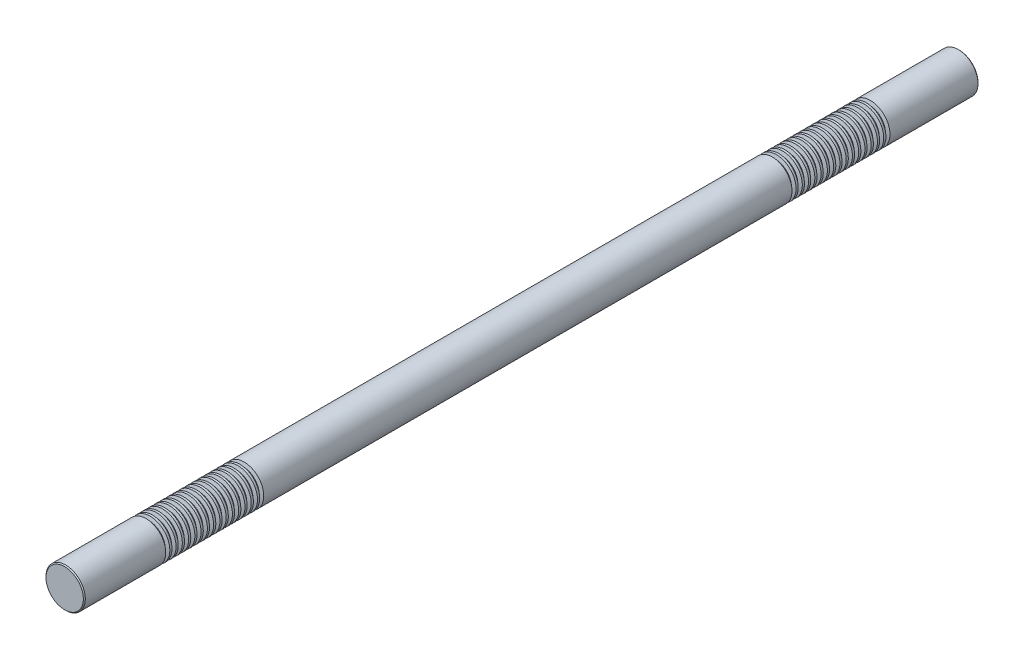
ISO-10303-21;
HEADER;
FILE_DESCRIPTION(('STEP AP214'),'2;1');
FILE_NAME('part.step','',(''),(''),'','','');
FILE_SCHEMA(('AUTOMOTIVE_DESIGN { 1 0 10303 214 1 1 1 1 }'));
ENDSEC;
DATA;
#1=APPLICATION_CONTEXT('core data for automotive mechanical design processes');
#2=APPLICATION_PROTOCOL_DEFINITION('international standard','automotive_design',2000,#1);
#3=PRODUCT_CONTEXT('',#1,'mechanical');
#4=PRODUCT('Part','Part','',(#3));
#5=PRODUCT_RELATED_PRODUCT_CATEGORY('part','',(#4));
#6=PRODUCT_DEFINITION_FORMATION('','',#4);
#7=PRODUCT_DEFINITION_CONTEXT('part definition',#1,'design');
#8=PRODUCT_DEFINITION('design','',#6,#7);
#9=PRODUCT_DEFINITION_SHAPE('','',#8);
#10=(LENGTH_UNIT() NAMED_UNIT(*) SI_UNIT(.MILLI.,.METRE.));
#11=(NAMED_UNIT(*) PLANE_ANGLE_UNIT() SI_UNIT($,.RADIAN.));
#12=(NAMED_UNIT(*) SI_UNIT($,.STERADIAN.) SOLID_ANGLE_UNIT());
#13=UNCERTAINTY_MEASURE_WITH_UNIT(LENGTH_MEASURE(1.E-05),#10,'distance_accuracy_value','');
#14=(GEOMETRIC_REPRESENTATION_CONTEXT(3) GLOBAL_UNCERTAINTY_ASSIGNED_CONTEXT((#13)) GLOBAL_UNIT_ASSIGNED_CONTEXT((#10,
#11,#12)) REPRESENTATION_CONTEXT('',''));
#15=CARTESIAN_POINT('',(0.,0.,0.));
#16=DIRECTION('',(0.,0.,1.));
#17=DIRECTION('',(1.,0.,0.));
#18=AXIS2_PLACEMENT_3D('',#15,#16,#17);
#19=CARTESIAN_POINT('',(0.,0.,500.));
#20=DIRECTION('',(0.,0.,-1.));
#21=DIRECTION('',(-1.,0.,0.));
#22=AXIS2_PLACEMENT_3D('',#19,#20,#21);
#23=CYLINDRICAL_SURFACE('',#22,22.);
#24=CARTESIAN_POINT('',(0.,0.,402.035898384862));
#25=DIRECTION('',(0.,0.,1.));
#26=DIRECTION('',(1.,0.,0.));
#27=AXIS2_PLACEMENT_3D('',#24,#25,#26);
#28=CIRCLE('',#27,22.);
#29=CARTESIAN_POINT('',(22.,0.,402.035898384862));
#30=VERTEX_POINT('',#29);
#31=EDGE_CURVE('E545',#30,#30,#28,.T.);
#32=ORIENTED_EDGE('',*,*,#31,.T.);
#33=EDGE_LOOP('',(#32));
#34=FACE_BOUND('',#33,.T.);
#35=CARTESIAN_POINT('',(0.,0.,404.464101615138));
#36=DIRECTION('',(0.,0.,1.));
#37=DIRECTION('',(1.,0.,0.));
#38=AXIS2_PLACEMENT_3D('',#35,#36,#37);
#39=CIRCLE('',#38,22.);
#40=CARTESIAN_POINT('',(22.,0.,404.464101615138));
#41=VERTEX_POINT('',#40);
#42=EDGE_CURVE('E557',#41,#41,#39,.T.);
#43=ORIENTED_EDGE('',*,*,#42,.F.);
#44=EDGE_LOOP('',(#43));
#45=FACE_BOUND('',#44,.T.);
#46=ADVANCED_FACE('F37',(#34,#45),#23,.T.);
#47=CARTESIAN_POINT('',(0.,0.,395.035898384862));
#48=DIRECTION('',(0.,0.,1.));
#49=DIRECTION('',(1.,0.,0.));
#50=AXIS2_PLACEMENT_3D('',#47,#48,#49);
#51=CIRCLE('',#50,22.);
#52=CARTESIAN_POINT('',(22.,0.,395.035898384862));
#53=VERTEX_POINT('',#52);
#54=EDGE_CURVE('E529',#53,#53,#51,.T.);
#55=ORIENTED_EDGE('',*,*,#54,.T.);
#56=EDGE_LOOP('',(#55));
#57=FACE_BOUND('',#56,.T.);
#58=CARTESIAN_POINT('',(0.,0.,397.464101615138));
#59=DIRECTION('',(0.,0.,1.));
#60=DIRECTION('',(1.,0.,0.));
#61=AXIS2_PLACEMENT_3D('',#58,#59,#60);
#62=CIRCLE('',#61,22.);
#63=CARTESIAN_POINT('',(22.,0.,397.464101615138));
#64=VERTEX_POINT('',#63);
#65=EDGE_CURVE('E541',#64,#64,#62,.T.);
#66=ORIENTED_EDGE('',*,*,#65,.F.);
#67=EDGE_LOOP('',(#66));
#68=FACE_BOUND('',#67,.T.);
#69=ADVANCED_FACE('F593',(#57,#68),#23,.T.);
#70=CARTESIAN_POINT('',(0.,0.,388.035898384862));
#71=DIRECTION('',(0.,0.,1.));
#72=DIRECTION('',(1.,0.,0.));
#73=AXIS2_PLACEMENT_3D('',#70,#71,#72);
#74=CIRCLE('',#73,22.);
#75=CARTESIAN_POINT('',(22.,0.,388.035898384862));
#76=VERTEX_POINT('',#75);
#77=EDGE_CURVE('E513',#76,#76,#74,.T.);
#78=ORIENTED_EDGE('',*,*,#77,.T.);
#79=EDGE_LOOP('',(#78));
#80=FACE_BOUND('',#79,.T.);
#81=CARTESIAN_POINT('',(0.,0.,390.464101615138));
#82=DIRECTION('',(0.,0.,1.));
#83=DIRECTION('',(1.,0.,0.));
#84=AXIS2_PLACEMENT_3D('',#81,#82,#83);
#85=CIRCLE('',#84,22.);
#86=CARTESIAN_POINT('',(22.,0.,390.464101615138));
#87=VERTEX_POINT('',#86);
#88=EDGE_CURVE('E525',#87,#87,#85,.T.);
#89=ORIENTED_EDGE('',*,*,#88,.F.);
#90=EDGE_LOOP('',(#89));
#91=FACE_BOUND('',#90,.T.);
#92=ADVANCED_FACE('F601',(#80,#91),#23,.T.);
#93=CARTESIAN_POINT('',(0.,0.,381.035898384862));
#94=DIRECTION('',(0.,0.,1.));
#95=DIRECTION('',(1.,0.,0.));
#96=AXIS2_PLACEMENT_3D('',#93,#94,#95);
#97=CIRCLE('',#96,22.);
#98=CARTESIAN_POINT('',(22.,0.,381.035898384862));
#99=VERTEX_POINT('',#98);
#100=EDGE_CURVE('E497',#99,#99,#97,.T.);
#101=ORIENTED_EDGE('',*,*,#100,.T.);
#102=EDGE_LOOP('',(#101));
#103=FACE_BOUND('',#102,.T.);
#104=CARTESIAN_POINT('',(0.,0.,383.464101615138));
#105=DIRECTION('',(0.,0.,1.));
#106=DIRECTION('',(1.,0.,0.));
#107=AXIS2_PLACEMENT_3D('',#104,#105,#106);
#108=CIRCLE('',#107,22.);
#109=CARTESIAN_POINT('',(22.,0.,383.464101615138));
#110=VERTEX_POINT('',#109);
#111=EDGE_CURVE('E509',#110,#110,#108,.T.);
#112=ORIENTED_EDGE('',*,*,#111,.F.);
#113=EDGE_LOOP('',(#112));
#114=FACE_BOUND('',#113,.T.);
#115=ADVANCED_FACE('F1238',(#103,#114),#23,.T.);
#116=CARTESIAN_POINT('',(0.,0.,374.035898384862));
#117=DIRECTION('',(0.,0.,1.));
#118=DIRECTION('',(1.,0.,0.));
#119=AXIS2_PLACEMENT_3D('',#116,#117,#118);
#120=CIRCLE('',#119,22.);
#121=CARTESIAN_POINT('',(22.,0.,374.035898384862));
#122=VERTEX_POINT('',#121);
#123=EDGE_CURVE('E481',#122,#122,#120,.T.);
#124=ORIENTED_EDGE('',*,*,#123,.T.);
#125=EDGE_LOOP('',(#124));
#126=FACE_BOUND('',#125,.T.);
#127=CARTESIAN_POINT('',(0.,0.,376.464101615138));
#128=DIRECTION('',(0.,0.,1.));
#129=DIRECTION('',(1.,0.,0.));
#130=AXIS2_PLACEMENT_3D('',#127,#128,#129);
#131=CIRCLE('',#130,22.);
#132=CARTESIAN_POINT('',(22.,0.,376.464101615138));
#133=VERTEX_POINT('',#132);
#134=EDGE_CURVE('E493',#133,#133,#131,.T.);
#135=ORIENTED_EDGE('',*,*,#134,.F.);
#136=EDGE_LOOP('',(#135));
#137=FACE_BOUND('',#136,.T.);
#138=ADVANCED_FACE('F1215',(#126,#137),#23,.T.);
#139=CARTESIAN_POINT('',(0.,0.,367.035898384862));
#140=DIRECTION('',(0.,0.,1.));
#141=DIRECTION('',(1.,0.,0.));
#142=AXIS2_PLACEMENT_3D('',#139,#140,#141);
#143=CIRCLE('',#142,22.);
#144=CARTESIAN_POINT('',(22.,0.,367.035898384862));
#145=VERTEX_POINT('',#144);
#146=EDGE_CURVE('E465',#145,#145,#143,.T.);
#147=ORIENTED_EDGE('',*,*,#146,.T.);
#148=EDGE_LOOP('',(#147));
#149=FACE_BOUND('',#148,.T.);
#150=CARTESIAN_POINT('',(0.,0.,369.464101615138));
#151=DIRECTION('',(0.,0.,1.));
#152=DIRECTION('',(1.,0.,0.));
#153=AXIS2_PLACEMENT_3D('',#150,#151,#152);
#154=CIRCLE('',#153,22.);
#155=CARTESIAN_POINT('',(22.,0.,369.464101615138));
#156=VERTEX_POINT('',#155);
#157=EDGE_CURVE('E477',#156,#156,#154,.T.);
#158=ORIENTED_EDGE('',*,*,#157,.F.);
#159=EDGE_LOOP('',(#158));
#160=FACE_BOUND('',#159,.T.);
#161=ADVANCED_FACE('F1192',(#149,#160),#23,.T.);
#162=CARTESIAN_POINT('',(0.,0.,360.035898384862));
#163=DIRECTION('',(0.,0.,1.));
#164=DIRECTION('',(1.,0.,0.));
#165=AXIS2_PLACEMENT_3D('',#162,#163,#164);
#166=CIRCLE('',#165,22.);
#167=CARTESIAN_POINT('',(22.,0.,360.035898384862));
#168=VERTEX_POINT('',#167);
#169=EDGE_CURVE('E449',#168,#168,#166,.T.);
#170=ORIENTED_EDGE('',*,*,#169,.T.);
#171=EDGE_LOOP('',(#170));
#172=FACE_BOUND('',#171,.T.);
#173=CARTESIAN_POINT('',(0.,0.,362.464101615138));
#174=DIRECTION('',(0.,0.,1.));
#175=DIRECTION('',(1.,0.,0.));
#176=AXIS2_PLACEMENT_3D('',#173,#174,#175);
#177=CIRCLE('',#176,22.);
#178=CARTESIAN_POINT('',(22.,0.,362.464101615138));
#179=VERTEX_POINT('',#178);
#180=EDGE_CURVE('E461',#179,#179,#177,.T.);
#181=ORIENTED_EDGE('',*,*,#180,.F.);
#182=EDGE_LOOP('',(#181));
#183=FACE_BOUND('',#182,.T.);
#184=ADVANCED_FACE('F1169',(#172,#183),#23,.T.);
#185=CARTESIAN_POINT('',(0.,0.,353.035898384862));
#186=DIRECTION('',(0.,0.,1.));
#187=DIRECTION('',(1.,0.,0.));
#188=AXIS2_PLACEMENT_3D('',#185,#186,#187);
#189=CIRCLE('',#188,22.);
#190=CARTESIAN_POINT('',(22.,0.,353.035898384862));
#191=VERTEX_POINT('',#190);
#192=EDGE_CURVE('E433',#191,#191,#189,.T.);
#193=ORIENTED_EDGE('',*,*,#192,.T.);
#194=EDGE_LOOP('',(#193));
#195=FACE_BOUND('',#194,.T.);
#196=CARTESIAN_POINT('',(0.,0.,355.464101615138));
#197=DIRECTION('',(0.,0.,1.));
#198=DIRECTION('',(1.,0.,0.));
#199=AXIS2_PLACEMENT_3D('',#196,#197,#198);
#200=CIRCLE('',#199,22.);
#201=CARTESIAN_POINT('',(22.,0.,355.464101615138));
#202=VERTEX_POINT('',#201);
#203=EDGE_CURVE('E445',#202,#202,#200,.T.);
#204=ORIENTED_EDGE('',*,*,#203,.F.);
#205=EDGE_LOOP('',(#204));
#206=FACE_BOUND('',#205,.T.);
#207=ADVANCED_FACE('F1146',(#195,#206),#23,.T.);
#208=CARTESIAN_POINT('',(0.,0.,346.035898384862));
#209=DIRECTION('',(0.,0.,1.));
#210=DIRECTION('',(1.,0.,0.));
#211=AXIS2_PLACEMENT_3D('',#208,#209,#210);
#212=CIRCLE('',#211,22.);
#213=CARTESIAN_POINT('',(22.,0.,346.035898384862));
#214=VERTEX_POINT('',#213);
#215=EDGE_CURVE('E417',#214,#214,#212,.T.);
#216=ORIENTED_EDGE('',*,*,#215,.T.);
#217=EDGE_LOOP('',(#216));
#218=FACE_BOUND('',#217,.T.);
#219=CARTESIAN_POINT('',(0.,0.,348.464101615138));
#220=DIRECTION('',(0.,0.,1.));
#221=DIRECTION('',(1.,0.,0.));
#222=AXIS2_PLACEMENT_3D('',#219,#220,#221);
#223=CIRCLE('',#222,22.);
#224=CARTESIAN_POINT('',(22.,0.,348.464101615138));
#225=VERTEX_POINT('',#224);
#226=EDGE_CURVE('E429',#225,#225,#223,.T.);
#227=ORIENTED_EDGE('',*,*,#226,.F.);
#228=EDGE_LOOP('',(#227));
#229=FACE_BOUND('',#228,.T.);
#230=ADVANCED_FACE('F1123',(#218,#229),#23,.T.);
#231=CARTESIAN_POINT('',(0.,0.,339.035898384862));
#232=DIRECTION('',(0.,0.,1.));
#233=DIRECTION('',(1.,0.,0.));
#234=AXIS2_PLACEMENT_3D('',#231,#232,#233);
#235=CIRCLE('',#234,22.);
#236=CARTESIAN_POINT('',(22.,0.,339.035898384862));
#237=VERTEX_POINT('',#236);
#238=EDGE_CURVE('E401',#237,#237,#235,.T.);
#239=ORIENTED_EDGE('',*,*,#238,.T.);
#240=EDGE_LOOP('',(#239));
#241=FACE_BOUND('',#240,.T.);
#242=CARTESIAN_POINT('',(0.,0.,341.464101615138));
#243=DIRECTION('',(0.,0.,1.));
#244=DIRECTION('',(1.,0.,0.));
#245=AXIS2_PLACEMENT_3D('',#242,#243,#244);
#246=CIRCLE('',#245,22.);
#247=CARTESIAN_POINT('',(22.,0.,341.464101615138));
#248=VERTEX_POINT('',#247);
#249=EDGE_CURVE('E413',#248,#248,#246,.T.);
#250=ORIENTED_EDGE('',*,*,#249,.F.);
#251=EDGE_LOOP('',(#250));
#252=FACE_BOUND('',#251,.T.);
#253=ADVANCED_FACE('F1100',(#241,#252),#23,.T.);
#254=CARTESIAN_POINT('',(0.,0.,332.035898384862));
#255=DIRECTION('',(0.,0.,1.));
#256=DIRECTION('',(1.,0.,0.));
#257=AXIS2_PLACEMENT_3D('',#254,#255,#256);
#258=CIRCLE('',#257,22.);
#259=CARTESIAN_POINT('',(22.,0.,332.035898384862));
#260=VERTEX_POINT('',#259);
#261=EDGE_CURVE('E385',#260,#260,#258,.T.);
#262=ORIENTED_EDGE('',*,*,#261,.T.);
#263=EDGE_LOOP('',(#262));
#264=FACE_BOUND('',#263,.T.);
#265=CARTESIAN_POINT('',(0.,0.,334.464101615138));
#266=DIRECTION('',(0.,0.,1.));
#267=DIRECTION('',(1.,0.,0.));
#268=AXIS2_PLACEMENT_3D('',#265,#266,#267);
#269=CIRCLE('',#268,22.);
#270=CARTESIAN_POINT('',(22.,0.,334.464101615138));
#271=VERTEX_POINT('',#270);
#272=EDGE_CURVE('E397',#271,#271,#269,.T.);
#273=ORIENTED_EDGE('',*,*,#272,.F.);
#274=EDGE_LOOP('',(#273));
#275=FACE_BOUND('',#274,.T.);
#276=ADVANCED_FACE('F1077',(#264,#275),#23,.T.);
#277=CARTESIAN_POINT('',(0.,0.,325.035898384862));
#278=DIRECTION('',(0.,0.,1.));
#279=DIRECTION('',(1.,0.,0.));
#280=AXIS2_PLACEMENT_3D('',#277,#278,#279);
#281=CIRCLE('',#280,22.);
#282=CARTESIAN_POINT('',(22.,0.,325.035898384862));
#283=VERTEX_POINT('',#282);
#284=EDGE_CURVE('E370',#283,#283,#281,.T.);
#285=ORIENTED_EDGE('',*,*,#284,.T.);
#286=EDGE_LOOP('',(#285));
#287=FACE_BOUND('',#286,.T.);
#288=CARTESIAN_POINT('',(0.,0.,327.464101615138));
#289=DIRECTION('',(0.,0.,1.));
#290=DIRECTION('',(1.,0.,0.));
#291=AXIS2_PLACEMENT_3D('',#288,#289,#290);
#292=CIRCLE('',#291,22.);
#293=CARTESIAN_POINT('',(22.,0.,327.464101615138));
#294=VERTEX_POINT('',#293);
#295=EDGE_CURVE('E381',#294,#294,#292,.T.);
#296=ORIENTED_EDGE('',*,*,#295,.F.);
#297=EDGE_LOOP('',(#296));
#298=FACE_BOUND('',#297,.T.);
#299=ADVANCED_FACE('F1054',(#287,#298),#23,.T.);
#300=CARTESIAN_POINT('',(0.,0.,318.035898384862));
#301=DIRECTION('',(0.,0.,1.));
#302=DIRECTION('',(1.,0.,0.));
#303=AXIS2_PLACEMENT_3D('',#300,#301,#302);
#304=CIRCLE('',#303,22.);
#305=CARTESIAN_POINT('',(22.,0.,318.035898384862));
#306=VERTEX_POINT('',#305);
#307=EDGE_CURVE('E354',#306,#306,#304,.T.);
#308=ORIENTED_EDGE('',*,*,#307,.T.);
#309=EDGE_LOOP('',(#308));
#310=FACE_BOUND('',#309,.T.);
#311=CARTESIAN_POINT('',(0.,0.,320.464101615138));
#312=DIRECTION('',(0.,0.,1.));
#313=DIRECTION('',(1.,0.,0.));
#314=AXIS2_PLACEMENT_3D('',#311,#312,#313);
#315=CIRCLE('',#314,22.);
#316=CARTESIAN_POINT('',(22.,0.,320.464101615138));
#317=VERTEX_POINT('',#316);
#318=EDGE_CURVE('E366',#317,#317,#315,.T.);
#319=ORIENTED_EDGE('',*,*,#318,.F.);
#320=EDGE_LOOP('',(#319));
#321=FACE_BOUND('',#320,.T.);
#322=ADVANCED_FACE('F1031',(#310,#321),#23,.T.);
#323=CARTESIAN_POINT('',(0.,0.,311.035898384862));
#324=DIRECTION('',(0.,0.,1.));
#325=DIRECTION('',(1.,0.,0.));
#326=AXIS2_PLACEMENT_3D('',#323,#324,#325);
#327=CIRCLE('',#326,22.);
#328=CARTESIAN_POINT('',(22.,0.,311.035898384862));
#329=VERTEX_POINT('',#328);
#330=EDGE_CURVE('E338',#329,#329,#327,.T.);
#331=ORIENTED_EDGE('',*,*,#330,.T.);
#332=EDGE_LOOP('',(#331));
#333=FACE_BOUND('',#332,.T.);
#334=CARTESIAN_POINT('',(0.,0.,313.464101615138));
#335=DIRECTION('',(0.,0.,1.));
#336=DIRECTION('',(1.,0.,0.));
#337=AXIS2_PLACEMENT_3D('',#334,#335,#336);
#338=CIRCLE('',#337,22.);
#339=CARTESIAN_POINT('',(22.,0.,313.464101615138));
#340=VERTEX_POINT('',#339);
#341=EDGE_CURVE('E350',#340,#340,#338,.T.);
#342=ORIENTED_EDGE('',*,*,#341,.F.);
#343=EDGE_LOOP('',(#342));
#344=FACE_BOUND('',#343,.T.);
#345=ADVANCED_FACE('F1008',(#333,#344),#23,.T.);
#346=CARTESIAN_POINT('',(0.,0.,304.035898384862));
#347=DIRECTION('',(0.,0.,1.));
#348=DIRECTION('',(1.,0.,0.));
#349=AXIS2_PLACEMENT_3D('',#346,#347,#348);
#350=CIRCLE('',#349,22.);
#351=CARTESIAN_POINT('',(22.,0.,304.035898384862));
#352=VERTEX_POINT('',#351);
#353=EDGE_CURVE('E322',#352,#352,#350,.T.);
#354=ORIENTED_EDGE('',*,*,#353,.T.);
#355=EDGE_LOOP('',(#354));
#356=FACE_BOUND('',#355,.T.);
#357=CARTESIAN_POINT('',(0.,0.,306.464101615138));
#358=DIRECTION('',(0.,0.,1.));
#359=DIRECTION('',(1.,0.,0.));
#360=AXIS2_PLACEMENT_3D('',#357,#358,#359);
#361=CIRCLE('',#360,22.);
#362=CARTESIAN_POINT('',(22.,0.,306.464101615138));
#363=VERTEX_POINT('',#362);
#364=EDGE_CURVE('E334',#363,#363,#361,.T.);
#365=ORIENTED_EDGE('',*,*,#364,.F.);
#366=EDGE_LOOP('',(#365));
#367=FACE_BOUND('',#366,.T.);
#368=ADVANCED_FACE('F985',(#356,#367),#23,.T.);
#369=CARTESIAN_POINT('',(0.,0.,-290.964101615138));
#370=DIRECTION('',(0.,0.,1.));
#371=DIRECTION('',(1.,0.,0.));
#372=AXIS2_PLACEMENT_3D('',#369,#370,#371);
#373=CIRCLE('',#372,22.);
#374=CARTESIAN_POINT('',(22.,0.,-290.964101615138));
#375=VERTEX_POINT('',#374);
#376=EDGE_CURVE('E307',#375,#375,#373,.T.);
#377=ORIENTED_EDGE('',*,*,#376,.T.);
#378=EDGE_LOOP('',(#377));
#379=FACE_BOUND('',#378,.T.);
#380=CARTESIAN_POINT('',(0.,0.,299.464101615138));
#381=DIRECTION('',(0.,0.,1.));
#382=DIRECTION('',(1.,0.,0.));
#383=AXIS2_PLACEMENT_3D('',#380,#381,#382);
#384=CIRCLE('',#383,22.);
#385=CARTESIAN_POINT('',(22.,0.,299.464101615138));
#386=VERTEX_POINT('',#385);
#387=EDGE_CURVE('E319',#386,#386,#384,.T.);
#388=ORIENTED_EDGE('',*,*,#387,.F.);
#389=EDGE_LOOP('',(#388));
#390=FACE_BOUND('',#389,.T.);
#391=ADVANCED_FACE('F962',(#379,#390),#23,.T.);
#392=CARTESIAN_POINT('',(0.,0.,-297.964101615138));
#393=DIRECTION('',(0.,0.,1.));
#394=DIRECTION('',(1.,0.,0.));
#395=AXIS2_PLACEMENT_3D('',#392,#393,#394);
#396=CIRCLE('',#395,22.);
#397=CARTESIAN_POINT('',(22.,0.,-297.964101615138));
#398=VERTEX_POINT('',#397);
#399=EDGE_CURVE('E291',#398,#398,#396,.T.);
#400=ORIENTED_EDGE('',*,*,#399,.T.);
#401=EDGE_LOOP('',(#400));
#402=FACE_BOUND('',#401,.T.);
#403=CARTESIAN_POINT('',(0.,0.,-295.535898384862));
#404=DIRECTION('',(0.,0.,1.));
#405=DIRECTION('',(1.,0.,0.));
#406=AXIS2_PLACEMENT_3D('',#403,#404,#405);
#407=CIRCLE('',#406,22.);
#408=CARTESIAN_POINT('',(22.,0.,-295.535898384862));
#409=VERTEX_POINT('',#408);
#410=EDGE_CURVE('E303',#409,#409,#407,.T.);
#411=ORIENTED_EDGE('',*,*,#410,.F.);
#412=EDGE_LOOP('',(#411));
#413=FACE_BOUND('',#412,.T.);
#414=ADVANCED_FACE('F939',(#402,#413),#23,.T.);
#415=CARTESIAN_POINT('',(0.,0.,-304.964101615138));
#416=DIRECTION('',(0.,0.,1.));
#417=DIRECTION('',(1.,0.,0.));
#418=AXIS2_PLACEMENT_3D('',#415,#416,#417);
#419=CIRCLE('',#418,22.);
#420=CARTESIAN_POINT('',(22.,0.,-304.964101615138));
#421=VERTEX_POINT('',#420);
#422=EDGE_CURVE('E275',#421,#421,#419,.T.);
#423=ORIENTED_EDGE('',*,*,#422,.T.);
#424=EDGE_LOOP('',(#423));
#425=FACE_BOUND('',#424,.T.);
#426=CARTESIAN_POINT('',(0.,0.,-302.535898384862));
#427=DIRECTION('',(0.,0.,1.));
#428=DIRECTION('',(1.,0.,0.));
#429=AXIS2_PLACEMENT_3D('',#426,#427,#428);
#430=CIRCLE('',#429,22.);
#431=CARTESIAN_POINT('',(22.,0.,-302.535898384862));
#432=VERTEX_POINT('',#431);
#433=EDGE_CURVE('E287',#432,#432,#430,.T.);
#434=ORIENTED_EDGE('',*,*,#433,.F.);
#435=EDGE_LOOP('',(#434));
#436=FACE_BOUND('',#435,.T.);
#437=ADVANCED_FACE('F916',(#425,#436),#23,.T.);
#438=CARTESIAN_POINT('',(0.,0.,-311.964101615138));
#439=DIRECTION('',(0.,0.,1.));
#440=DIRECTION('',(1.,0.,0.));
#441=AXIS2_PLACEMENT_3D('',#438,#439,#440);
#442=CIRCLE('',#441,22.);
#443=CARTESIAN_POINT('',(22.,0.,-311.964101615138));
#444=VERTEX_POINT('',#443);
#445=EDGE_CURVE('E259',#444,#444,#442,.T.);
#446=ORIENTED_EDGE('',*,*,#445,.T.);
#447=EDGE_LOOP('',(#446));
#448=FACE_BOUND('',#447,.T.);
#449=CARTESIAN_POINT('',(0.,0.,-309.535898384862));
#450=DIRECTION('',(0.,0.,1.));
#451=DIRECTION('',(1.,0.,0.));
#452=AXIS2_PLACEMENT_3D('',#449,#450,#451);
#453=CIRCLE('',#452,22.);
#454=CARTESIAN_POINT('',(22.,0.,-309.535898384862));
#455=VERTEX_POINT('',#454);
#456=EDGE_CURVE('E271',#455,#455,#453,.T.);
#457=ORIENTED_EDGE('',*,*,#456,.F.);
#458=EDGE_LOOP('',(#457));
#459=FACE_BOUND('',#458,.T.);
#460=ADVANCED_FACE('F893',(#448,#459),#23,.T.);
#461=CARTESIAN_POINT('',(0.,0.,-318.964101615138));
#462=DIRECTION('',(0.,0.,1.));
#463=DIRECTION('',(1.,0.,0.));
#464=AXIS2_PLACEMENT_3D('',#461,#462,#463);
#465=CIRCLE('',#464,22.);
#466=CARTESIAN_POINT('',(22.,0.,-318.964101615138));
#467=VERTEX_POINT('',#466);
#468=EDGE_CURVE('E243',#467,#467,#465,.T.);
#469=ORIENTED_EDGE('',*,*,#468,.T.);
#470=EDGE_LOOP('',(#469));
#471=FACE_BOUND('',#470,.T.);
#472=CARTESIAN_POINT('',(0.,0.,-316.535898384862));
#473=DIRECTION('',(0.,0.,1.));
#474=DIRECTION('',(1.,0.,0.));
#475=AXIS2_PLACEMENT_3D('',#472,#473,#474);
#476=CIRCLE('',#475,22.);
#477=CARTESIAN_POINT('',(22.,0.,-316.535898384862));
#478=VERTEX_POINT('',#477);
#479=EDGE_CURVE('E255',#478,#478,#476,.T.);
#480=ORIENTED_EDGE('',*,*,#479,.F.);
#481=EDGE_LOOP('',(#480));
#482=FACE_BOUND('',#481,.T.);
#483=ADVANCED_FACE('F870',(#471,#482),#23,.T.);
#484=CARTESIAN_POINT('',(0.,0.,-325.964101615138));
#485=DIRECTION('',(0.,0.,1.));
#486=DIRECTION('',(1.,0.,0.));
#487=AXIS2_PLACEMENT_3D('',#484,#485,#486);
#488=CIRCLE('',#487,22.);
#489=CARTESIAN_POINT('',(22.,0.,-325.964101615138));
#490=VERTEX_POINT('',#489);
#491=EDGE_CURVE('E228',#490,#490,#488,.T.);
#492=ORIENTED_EDGE('',*,*,#491,.T.);
#493=EDGE_LOOP('',(#492));
#494=FACE_BOUND('',#493,.T.);
#495=CARTESIAN_POINT('',(0.,0.,-323.535898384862));
#496=DIRECTION('',(0.,0.,1.));
#497=DIRECTION('',(1.,0.,0.));
#498=AXIS2_PLACEMENT_3D('',#495,#496,#497);
#499=CIRCLE('',#498,22.);
#500=CARTESIAN_POINT('',(22.,0.,-323.535898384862));
#501=VERTEX_POINT('',#500);
#502=EDGE_CURVE('E240',#501,#501,#499,.T.);
#503=ORIENTED_EDGE('',*,*,#502,.F.);
#504=EDGE_LOOP('',(#503));
#505=FACE_BOUND('',#504,.T.);
#506=ADVANCED_FACE('F847',(#494,#505),#23,.T.);
#507=CARTESIAN_POINT('',(0.,0.,-332.964101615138));
#508=DIRECTION('',(0.,0.,1.));
#509=DIRECTION('',(1.,0.,0.));
#510=AXIS2_PLACEMENT_3D('',#507,#508,#509);
#511=CIRCLE('',#510,22.);
#512=CARTESIAN_POINT('',(22.,0.,-332.964101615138));
#513=VERTEX_POINT('',#512);
#514=EDGE_CURVE('E213',#513,#513,#511,.T.);
#515=ORIENTED_EDGE('',*,*,#514,.T.);
#516=EDGE_LOOP('',(#515));
#517=FACE_BOUND('',#516,.T.);
#518=CARTESIAN_POINT('',(0.,0.,-330.535898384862));
#519=DIRECTION('',(0.,0.,1.));
#520=DIRECTION('',(1.,0.,0.));
#521=AXIS2_PLACEMENT_3D('',#518,#519,#520);
#522=CIRCLE('',#521,22.);
#523=CARTESIAN_POINT('',(22.,0.,-330.535898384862));
#524=VERTEX_POINT('',#523);
#525=EDGE_CURVE('E224',#524,#524,#522,.T.);
#526=ORIENTED_EDGE('',*,*,#525,.F.);
#527=EDGE_LOOP('',(#526));
#528=FACE_BOUND('',#527,.T.);
#529=ADVANCED_FACE('F824',(#517,#528),#23,.T.);
#530=CARTESIAN_POINT('',(0.,0.,-339.964101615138));
#531=DIRECTION('',(0.,0.,1.));
#532=DIRECTION('',(1.,0.,0.));
#533=AXIS2_PLACEMENT_3D('',#530,#531,#532);
#534=CIRCLE('',#533,22.);
#535=CARTESIAN_POINT('',(22.,0.,-339.964101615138));
#536=VERTEX_POINT('',#535);
#537=EDGE_CURVE('E197',#536,#536,#534,.T.);
#538=ORIENTED_EDGE('',*,*,#537,.T.);
#539=EDGE_LOOP('',(#538));
#540=FACE_BOUND('',#539,.T.);
#541=CARTESIAN_POINT('',(0.,0.,-337.535898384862));
#542=DIRECTION('',(0.,0.,1.));
#543=DIRECTION('',(1.,0.,0.));
#544=AXIS2_PLACEMENT_3D('',#541,#542,#543);
#545=CIRCLE('',#544,22.);
#546=CARTESIAN_POINT('',(22.,0.,-337.535898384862));
#547=VERTEX_POINT('',#546);
#548=EDGE_CURVE('E209',#547,#547,#545,.T.);
#549=ORIENTED_EDGE('',*,*,#548,.F.);
#550=EDGE_LOOP('',(#549));
#551=FACE_BOUND('',#550,.T.);
#552=ADVANCED_FACE('F801',(#540,#551),#23,.T.);
#553=CARTESIAN_POINT('',(0.,0.,-346.964101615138));
#554=DIRECTION('',(0.,0.,1.));
#555=DIRECTION('',(1.,0.,0.));
#556=AXIS2_PLACEMENT_3D('',#553,#554,#555);
#557=CIRCLE('',#556,22.);
#558=CARTESIAN_POINT('',(22.,0.,-346.964101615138));
#559=VERTEX_POINT('',#558);
#560=EDGE_CURVE('E181',#559,#559,#557,.T.);
#561=ORIENTED_EDGE('',*,*,#560,.T.);
#562=EDGE_LOOP('',(#561));
#563=FACE_BOUND('',#562,.T.);
#564=CARTESIAN_POINT('',(0.,0.,-344.535898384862));
#565=DIRECTION('',(0.,0.,1.));
#566=DIRECTION('',(1.,0.,0.));
#567=AXIS2_PLACEMENT_3D('',#564,#565,#566);
#568=CIRCLE('',#567,22.);
#569=CARTESIAN_POINT('',(22.,0.,-344.535898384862));
#570=VERTEX_POINT('',#569);
#571=EDGE_CURVE('E193',#570,#570,#568,.T.);
#572=ORIENTED_EDGE('',*,*,#571,.F.);
#573=EDGE_LOOP('',(#572));
#574=FACE_BOUND('',#573,.T.);
#575=ADVANCED_FACE('F778',(#563,#574),#23,.T.);
#576=CARTESIAN_POINT('',(0.,0.,-353.964101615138));
#577=DIRECTION('',(0.,0.,1.));
#578=DIRECTION('',(1.,0.,0.));
#579=AXIS2_PLACEMENT_3D('',#576,#577,#578);
#580=CIRCLE('',#579,22.);
#581=CARTESIAN_POINT('',(22.,0.,-353.964101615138));
#582=VERTEX_POINT('',#581);
#583=EDGE_CURVE('E165',#582,#582,#580,.T.);
#584=ORIENTED_EDGE('',*,*,#583,.T.);
#585=EDGE_LOOP('',(#584));
#586=FACE_BOUND('',#585,.T.);
#587=CARTESIAN_POINT('',(0.,0.,-351.535898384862));
#588=DIRECTION('',(0.,0.,1.));
#589=DIRECTION('',(1.,0.,0.));
#590=AXIS2_PLACEMENT_3D('',#587,#588,#589);
#591=CIRCLE('',#590,22.);
#592=CARTESIAN_POINT('',(22.,0.,-351.535898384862));
#593=VERTEX_POINT('',#592);
#594=EDGE_CURVE('E177',#593,#593,#591,.T.);
#595=ORIENTED_EDGE('',*,*,#594,.F.);
#596=EDGE_LOOP('',(#595));
#597=FACE_BOUND('',#596,.T.);
#598=ADVANCED_FACE('F755',(#586,#597),#23,.T.);
#599=CARTESIAN_POINT('',(0.,0.,-360.964101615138));
#600=DIRECTION('',(0.,0.,1.));
#601=DIRECTION('',(1.,0.,0.));
#602=AXIS2_PLACEMENT_3D('',#599,#600,#601);
#603=CIRCLE('',#602,22.);
#604=CARTESIAN_POINT('',(22.,0.,-360.964101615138));
#605=VERTEX_POINT('',#604);
#606=EDGE_CURVE('E149',#605,#605,#603,.T.);
#607=ORIENTED_EDGE('',*,*,#606,.T.);
#608=EDGE_LOOP('',(#607));
#609=FACE_BOUND('',#608,.T.);
#610=CARTESIAN_POINT('',(0.,0.,-358.535898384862));
#611=DIRECTION('',(0.,0.,1.));
#612=DIRECTION('',(1.,0.,0.));
#613=AXIS2_PLACEMENT_3D('',#610,#611,#612);
#614=CIRCLE('',#613,22.);
#615=CARTESIAN_POINT('',(22.,0.,-358.535898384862));
#616=VERTEX_POINT('',#615);
#617=EDGE_CURVE('E161',#616,#616,#614,.T.);
#618=ORIENTED_EDGE('',*,*,#617,.F.);
#619=EDGE_LOOP('',(#618));
#620=FACE_BOUND('',#619,.T.);
#621=ADVANCED_FACE('F732',(#609,#620),#23,.T.);
#622=CARTESIAN_POINT('',(0.,0.,-367.964101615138));
#623=DIRECTION('',(0.,0.,1.));
#624=DIRECTION('',(1.,0.,0.));
#625=AXIS2_PLACEMENT_3D('',#622,#623,#624);
#626=CIRCLE('',#625,22.);
#627=CARTESIAN_POINT('',(22.,0.,-367.964101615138));
#628=VERTEX_POINT('',#627);
#629=EDGE_CURVE('E133',#628,#628,#626,.T.);
#630=ORIENTED_EDGE('',*,*,#629,.T.);
#631=EDGE_LOOP('',(#630));
#632=FACE_BOUND('',#631,.T.);
#633=CARTESIAN_POINT('',(0.,0.,-365.535898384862));
#634=DIRECTION('',(0.,0.,1.));
#635=DIRECTION('',(1.,0.,0.));
#636=AXIS2_PLACEMENT_3D('',#633,#634,#635);
#637=CIRCLE('',#636,22.);
#638=CARTESIAN_POINT('',(22.,0.,-365.535898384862));
#639=VERTEX_POINT('',#638);
#640=EDGE_CURVE('E145',#639,#639,#637,.T.);
#641=ORIENTED_EDGE('',*,*,#640,.F.);
#642=EDGE_LOOP('',(#641));
#643=FACE_BOUND('',#642,.T.);
#644=ADVANCED_FACE('F709',(#632,#643),#23,.T.);
#645=CARTESIAN_POINT('',(0.,0.,-374.964101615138));
#646=DIRECTION('',(0.,0.,1.));
#647=DIRECTION('',(1.,0.,0.));
#648=AXIS2_PLACEMENT_3D('',#645,#646,#647);
#649=CIRCLE('',#648,22.);
#650=CARTESIAN_POINT('',(22.,0.,-374.964101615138));
#651=VERTEX_POINT('',#650);
#652=EDGE_CURVE('E117',#651,#651,#649,.T.);
#653=ORIENTED_EDGE('',*,*,#652,.T.);
#654=EDGE_LOOP('',(#653));
#655=FACE_BOUND('',#654,.T.);
#656=CARTESIAN_POINT('',(0.,0.,-372.535898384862));
#657=DIRECTION('',(0.,0.,1.));
#658=DIRECTION('',(1.,0.,0.));
#659=AXIS2_PLACEMENT_3D('',#656,#657,#658);
#660=CIRCLE('',#659,22.);
#661=CARTESIAN_POINT('',(22.,0.,-372.535898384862));
#662=VERTEX_POINT('',#661);
#663=EDGE_CURVE('E129',#662,#662,#660,.T.);
#664=ORIENTED_EDGE('',*,*,#663,.F.);
#665=EDGE_LOOP('',(#664));
#666=FACE_BOUND('',#665,.T.);
#667=ADVANCED_FACE('F686',(#655,#666),#23,.T.);
#668=CARTESIAN_POINT('',(0.,0.,-381.964101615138));
#669=DIRECTION('',(0.,0.,1.));
#670=DIRECTION('',(1.,0.,0.));
#671=AXIS2_PLACEMENT_3D('',#668,#669,#670);
#672=CIRCLE('',#671,22.);
#673=CARTESIAN_POINT('',(22.,0.,-381.964101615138));
#674=VERTEX_POINT('',#673);
#675=EDGE_CURVE('E101',#674,#674,#672,.T.);
#676=ORIENTED_EDGE('',*,*,#675,.T.);
#677=EDGE_LOOP('',(#676));
#678=FACE_BOUND('',#677,.T.);
#679=CARTESIAN_POINT('',(0.,0.,-379.535898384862));
#680=DIRECTION('',(0.,0.,1.));
#681=DIRECTION('',(1.,0.,0.));
#682=AXIS2_PLACEMENT_3D('',#679,#680,#681);
#683=CIRCLE('',#682,22.);
#684=CARTESIAN_POINT('',(22.,0.,-379.535898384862));
#685=VERTEX_POINT('',#684);
#686=EDGE_CURVE('E113',#685,#685,#683,.T.);
#687=ORIENTED_EDGE('',*,*,#686,.F.);
#688=EDGE_LOOP('',(#687));
#689=FACE_BOUND('',#688,.T.);
#690=ADVANCED_FACE('F663',(#678,#689),#23,.T.);
#691=CARTESIAN_POINT('',(0.,0.,-388.964101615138));
#692=DIRECTION('',(0.,0.,1.));
#693=DIRECTION('',(1.,0.,0.));
#694=AXIS2_PLACEMENT_3D('',#691,#692,#693);
#695=CIRCLE('',#694,22.);
#696=CARTESIAN_POINT('',(22.,0.,-388.964101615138));
#697=VERTEX_POINT('',#696);
#698=EDGE_CURVE('E85',#697,#697,#695,.T.);
#699=ORIENTED_EDGE('',*,*,#698,.T.);
#700=EDGE_LOOP('',(#699));
#701=FACE_BOUND('',#700,.T.);
#702=CARTESIAN_POINT('',(0.,0.,-386.535898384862));
#703=DIRECTION('',(0.,0.,1.));
#704=DIRECTION('',(1.,0.,0.));
#705=AXIS2_PLACEMENT_3D('',#702,#703,#704);
#706=CIRCLE('',#705,22.);
#707=CARTESIAN_POINT('',(22.,0.,-386.535898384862));
#708=VERTEX_POINT('',#707);
#709=EDGE_CURVE('E97',#708,#708,#706,.T.);
#710=ORIENTED_EDGE('',*,*,#709,.F.);
#711=EDGE_LOOP('',(#710));
#712=FACE_BOUND('',#711,.T.);
#713=ADVANCED_FACE('F616',(#701,#712),#23,.T.);
#714=CARTESIAN_POINT('',(0.,0.,-395.964101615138));
#715=DIRECTION('',(0.,0.,1.));
#716=DIRECTION('',(1.,0.,0.));
#717=AXIS2_PLACEMENT_3D('',#714,#715,#716);
#718=CIRCLE('',#717,22.);
#719=CARTESIAN_POINT('',(22.,0.,-395.964101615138));
#720=VERTEX_POINT('',#719);
#721=EDGE_CURVE('E69',#720,#720,#718,.T.);
#722=ORIENTED_EDGE('',*,*,#721,.T.);
#723=EDGE_LOOP('',(#722));
#724=FACE_BOUND('',#723,.T.);
#725=CARTESIAN_POINT('',(0.,0.,-393.535898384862));
#726=DIRECTION('',(0.,0.,1.));
#727=DIRECTION('',(1.,0.,0.));
#728=AXIS2_PLACEMENT_3D('',#725,#726,#727);
#729=CIRCLE('',#728,22.);
#730=CARTESIAN_POINT('',(22.,0.,-393.535898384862));
#731=VERTEX_POINT('',#730);
#732=EDGE_CURVE('E81',#731,#731,#729,.T.);
#733=ORIENTED_EDGE('',*,*,#732,.F.);
#734=EDGE_LOOP('',(#733));
#735=FACE_BOUND('',#734,.T.);
#736=ADVANCED_FACE('F609',(#724,#735),#23,.T.);
#737=CARTESIAN_POINT('',(0.,0.,-498.9));
#738=DIRECTION('',(0.,0.,1.));
#739=DIRECTION('',(1.,0.,0.));
#740=AXIS2_PLACEMENT_3D('',#737,#738,#739);
#741=CIRCLE('',#740,22.);
#742=CARTESIAN_POINT('',(22.,0.,-498.9));
#743=VERTEX_POINT('',#742);
#744=EDGE_CURVE('E52',#743,#743,#741,.T.);
#745=ORIENTED_EDGE('',*,*,#744,.T.);
#746=EDGE_LOOP('',(#745));
#747=FACE_BOUND('',#746,.T.);
#748=CARTESIAN_POINT('',(0.,0.,-400.535898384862));
#749=DIRECTION('',(0.,0.,1.));
#750=DIRECTION('',(1.,0.,0.));
#751=AXIS2_PLACEMENT_3D('',#748,#749,#750);
#752=CIRCLE('',#751,22.);
#753=CARTESIAN_POINT('',(22.,0.,-400.535898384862));
#754=VERTEX_POINT('',#753);
#755=EDGE_CURVE('E65',#754,#754,#752,.T.);
#756=ORIENTED_EDGE('',*,*,#755,.F.);
#757=EDGE_LOOP('',(#756));
#758=FACE_BOUND('',#757,.T.);
#759=ADVANCED_FACE('F597',(#747,#758),#23,.T.);
#760=CARTESIAN_POINT('',(0.,0.,-500.));
#761=DIRECTION('',(0.,0.,1.));
#762=DIRECTION('',(1.,0.,0.));
#763=AXIS2_PLACEMENT_3D('',#760,#761,#762);
#764=PLANE('',#763);
#765=CARTESIAN_POINT('',(0.,0.,-500.));
#766=DIRECTION('',(0.,0.,1.));
#767=DIRECTION('',(1.,0.,0.));
#768=AXIS2_PLACEMENT_3D('',#765,#766,#767);
#769=CIRCLE('',#768,20.9000000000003);
#770=CARTESIAN_POINT('',(20.9000000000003,0.,-500.));
#771=VERTEX_POINT('',#770);
#772=EDGE_CURVE('E45',#771,#771,#769,.F.);
#773=ORIENTED_EDGE('',*,*,#772,.T.);
#774=EDGE_LOOP('',(#773));
#775=FACE_BOUND('',#774,.T.);
#776=ADVANCED_FACE('F608',(#775),#764,.F.);
#777=CARTESIAN_POINT('',(0.,0.,-498.9));
#778=DIRECTION('',(0.,0.,1.));
#779=DIRECTION('',(1.,0.,0.));
#780=AXIS2_PLACEMENT_3D('',#777,#778,#779);
#781=CONICAL_SURFACE('',#780,22.,0.785398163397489);
#782=ORIENTED_EDGE('',*,*,#772,.F.);
#783=EDGE_LOOP('',(#782));
#784=FACE_BOUND('',#783,.T.);
#785=ORIENTED_EDGE('',*,*,#744,.F.);
#786=EDGE_LOOP('',(#785));
#787=FACE_BOUND('',#786,.T.);
#788=ADVANCED_FACE('F615',(#784,#787),#781,.T.);
#789=CARTESIAN_POINT('',(0.,0.,-399.464101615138));
#790=DIRECTION('',(0.,0.,-1.));
#791=DIRECTION('',(-1.,0.,0.));
#792=AXIS2_PLACEMENT_3D('',#789,#790,#791);
#793=CONICAL_SURFACE('',#792,18.,1.30899693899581);
#794=ORIENTED_EDGE('',*,*,#755,.T.);
#795=EDGE_LOOP('',(#794));
#796=FACE_BOUND('',#795,.T.);
#797=CARTESIAN_POINT('',(0.,0.,-399.464101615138));
#798=DIRECTION('',(0.,0.,1.));
#799=DIRECTION('',(1.,0.,0.));
#800=AXIS2_PLACEMENT_3D('',#797,#798,#799);
#801=CIRCLE('',#800,18.);
#802=CARTESIAN_POINT('',(18.,0.,-399.464101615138));
#803=VERTEX_POINT('',#802);
#804=EDGE_CURVE('E77',#803,#803,#801,.T.);
#805=ORIENTED_EDGE('',*,*,#804,.F.);
#806=EDGE_LOOP('',(#805));
#807=FACE_BOUND('',#806,.T.);
#808=ADVANCED_FACE('F622',(#796,#807),#793,.T.);
#809=CARTESIAN_POINT('',(0.,0.,-395.964101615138));
#810=DIRECTION('',(0.,0.,1.));
#811=DIRECTION('',(1.,0.,0.));
#812=AXIS2_PLACEMENT_3D('',#809,#810,#811);
#813=CONICAL_SURFACE('',#812,22.,1.30899693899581);
#814=CARTESIAN_POINT('',(0.,0.,-397.035898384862));
#815=DIRECTION('',(0.,0.,1.));
#816=DIRECTION('',(1.,0.,0.));
#817=AXIS2_PLACEMENT_3D('',#814,#815,#816);
#818=CIRCLE('',#817,18.);
#819=CARTESIAN_POINT('',(18.,0.,-397.035898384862));
#820=VERTEX_POINT('',#819);
#821=EDGE_CURVE('E73',#820,#820,#818,.T.);
#822=ORIENTED_EDGE('',*,*,#821,.T.);
#823=EDGE_LOOP('',(#822));
#824=FACE_BOUND('',#823,.T.);
#825=ORIENTED_EDGE('',*,*,#721,.F.);
#826=EDGE_LOOP('',(#825));
#827=FACE_BOUND('',#826,.T.);
#828=ADVANCED_FACE('F625',(#824,#827),#813,.T.);
#829=CARTESIAN_POINT('',(0.,0.,498.9));
#830=DIRECTION('',(0.,0.,1.));
#831=DIRECTION('',(1.,0.,0.));
#832=AXIS2_PLACEMENT_3D('',#829,#830,#831);
#833=CYLINDRICAL_SURFACE('',#832,18.);
#834=ORIENTED_EDGE('',*,*,#804,.T.);
#835=EDGE_LOOP('',(#834));
#836=FACE_BOUND('',#835,.T.);
#837=ORIENTED_EDGE('',*,*,#821,.F.);
#838=EDGE_LOOP('',(#837));
#839=FACE_BOUND('',#838,.T.);
#840=ADVANCED_FACE('F629',(#836,#839),#833,.T.);
#841=CARTESIAN_POINT('',(0.,0.,-392.464101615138));
#842=DIRECTION('',(0.,0.,-1.));
#843=DIRECTION('',(-1.,0.,0.));
#844=AXIS2_PLACEMENT_3D('',#841,#842,#843);
#845=CONICAL_SURFACE('',#844,18.,1.30899693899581);
#846=ORIENTED_EDGE('',*,*,#732,.T.);
#847=EDGE_LOOP('',(#846));
#848=FACE_BOUND('',#847,.T.);
#849=CARTESIAN_POINT('',(0.,0.,-392.464101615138));
#850=DIRECTION('',(0.,0.,1.));
#851=DIRECTION('',(1.,0.,0.));
#852=AXIS2_PLACEMENT_3D('',#849,#850,#851);
#853=CIRCLE('',#852,18.);
#854=CARTESIAN_POINT('',(18.,0.,-392.464101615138));
#855=VERTEX_POINT('',#854);
#856=EDGE_CURVE('E93',#855,#855,#853,.T.);
#857=ORIENTED_EDGE('',*,*,#856,.F.);
#858=EDGE_LOOP('',(#857));
#859=FACE_BOUND('',#858,.T.);
#860=ADVANCED_FACE('F632',(#848,#859),#845,.T.);
#861=CARTESIAN_POINT('',(0.,0.,-388.964101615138));
#862=DIRECTION('',(0.,0.,1.));
#863=DIRECTION('',(1.,0.,0.));
#864=AXIS2_PLACEMENT_3D('',#861,#862,#863);
#865=CONICAL_SURFACE('',#864,22.,1.30899693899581);
#866=CARTESIAN_POINT('',(0.,0.,-390.035898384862));
#867=DIRECTION('',(0.,0.,1.));
#868=DIRECTION('',(1.,0.,0.));
#869=AXIS2_PLACEMENT_3D('',#866,#867,#868);
#870=CIRCLE('',#869,18.);
#871=CARTESIAN_POINT('',(18.,0.,-390.035898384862));
#872=VERTEX_POINT('',#871);
#873=EDGE_CURVE('E89',#872,#872,#870,.T.);
#874=ORIENTED_EDGE('',*,*,#873,.T.);
#875=EDGE_LOOP('',(#874));
#876=FACE_BOUND('',#875,.T.);
#877=ORIENTED_EDGE('',*,*,#698,.F.);
#878=EDGE_LOOP('',(#877));
#879=FACE_BOUND('',#878,.T.);
#880=ADVANCED_FACE('F645',(#876,#879),#865,.T.);
#881=CARTESIAN_POINT('',(0.,0.,-393.535898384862));
#882=DIRECTION('',(0.,0.,1.));
#883=DIRECTION('',(1.,0.,0.));
#884=AXIS2_PLACEMENT_3D('',#881,#882,#883);
#885=CYLINDRICAL_SURFACE('',#884,18.);
#886=ORIENTED_EDGE('',*,*,#856,.T.);
#887=EDGE_LOOP('',(#886));
#888=FACE_BOUND('',#887,.T.);
#889=ORIENTED_EDGE('',*,*,#873,.F.);
#890=EDGE_LOOP('',(#889));
#891=FACE_BOUND('',#890,.T.);
#892=ADVANCED_FACE('F649',(#888,#891),#885,.T.);
#893=CARTESIAN_POINT('',(0.,0.,-385.464101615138));
#894=DIRECTION('',(0.,0.,-1.));
#895=DIRECTION('',(-1.,0.,0.));
#896=AXIS2_PLACEMENT_3D('',#893,#894,#895);
#897=CONICAL_SURFACE('',#896,18.,1.30899693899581);
#898=ORIENTED_EDGE('',*,*,#709,.T.);
#899=EDGE_LOOP('',(#898));
#900=FACE_BOUND('',#899,.T.);
#901=CARTESIAN_POINT('',(0.,0.,-385.464101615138));
#902=DIRECTION('',(0.,0.,1.));
#903=DIRECTION('',(1.,0.,0.));
#904=AXIS2_PLACEMENT_3D('',#901,#902,#903);
#905=CIRCLE('',#904,18.);
#906=CARTESIAN_POINT('',(18.,0.,-385.464101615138));
#907=VERTEX_POINT('',#906);
#908=EDGE_CURVE('E109',#907,#907,#905,.T.);
#909=ORIENTED_EDGE('',*,*,#908,.F.);
#910=EDGE_LOOP('',(#909));
#911=FACE_BOUND('',#910,.T.);
#912=ADVANCED_FACE('F652',(#900,#911),#897,.T.);
#913=CARTESIAN_POINT('',(0.,0.,-381.964101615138));
#914=DIRECTION('',(0.,0.,1.));
#915=DIRECTION('',(1.,0.,0.));
#916=AXIS2_PLACEMENT_3D('',#913,#914,#915);
#917=CONICAL_SURFACE('',#916,22.,1.30899693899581);
#918=CARTESIAN_POINT('',(0.,0.,-383.035898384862));
#919=DIRECTION('',(0.,0.,1.));
#920=DIRECTION('',(1.,0.,0.));
#921=AXIS2_PLACEMENT_3D('',#918,#919,#920);
#922=CIRCLE('',#921,18.);
#923=CARTESIAN_POINT('',(18.,0.,-383.035898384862));
#924=VERTEX_POINT('',#923);
#925=EDGE_CURVE('E105',#924,#924,#922,.T.);
#926=ORIENTED_EDGE('',*,*,#925,.T.);
#927=EDGE_LOOP('',(#926));
#928=FACE_BOUND('',#927,.T.);
#929=ORIENTED_EDGE('',*,*,#675,.F.);
#930=EDGE_LOOP('',(#929));
#931=FACE_BOUND('',#930,.T.);
#932=ADVANCED_FACE('F668',(#928,#931),#917,.T.);
#933=CARTESIAN_POINT('',(0.,0.,-386.535898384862));
#934=DIRECTION('',(0.,0.,1.));
#935=DIRECTION('',(1.,0.,0.));
#936=AXIS2_PLACEMENT_3D('',#933,#934,#935);
#937=CYLINDRICAL_SURFACE('',#936,18.);
#938=ORIENTED_EDGE('',*,*,#908,.T.);
#939=EDGE_LOOP('',(#938));
#940=FACE_BOUND('',#939,.T.);
#941=ORIENTED_EDGE('',*,*,#925,.F.);
#942=EDGE_LOOP('',(#941));
#943=FACE_BOUND('',#942,.T.);
#944=ADVANCED_FACE('F672',(#940,#943),#937,.T.);
#945=CARTESIAN_POINT('',(0.,0.,-378.464101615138));
#946=DIRECTION('',(0.,0.,-1.));
#947=DIRECTION('',(-1.,0.,0.));
#948=AXIS2_PLACEMENT_3D('',#945,#946,#947);
#949=CONICAL_SURFACE('',#948,18.,1.30899693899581);
#950=ORIENTED_EDGE('',*,*,#686,.T.);
#951=EDGE_LOOP('',(#950));
#952=FACE_BOUND('',#951,.T.);
#953=CARTESIAN_POINT('',(0.,0.,-378.464101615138));
#954=DIRECTION('',(0.,0.,1.));
#955=DIRECTION('',(1.,0.,0.));
#956=AXIS2_PLACEMENT_3D('',#953,#954,#955);
#957=CIRCLE('',#956,18.);
#958=CARTESIAN_POINT('',(18.,0.,-378.464101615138));
#959=VERTEX_POINT('',#958);
#960=EDGE_CURVE('E125',#959,#959,#957,.T.);
#961=ORIENTED_EDGE('',*,*,#960,.F.);
#962=EDGE_LOOP('',(#961));
#963=FACE_BOUND('',#962,.T.);
#964=ADVANCED_FACE('F675',(#952,#963),#949,.T.);
#965=CARTESIAN_POINT('',(0.,0.,-374.964101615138));
#966=DIRECTION('',(0.,0.,1.));
#967=DIRECTION('',(1.,0.,0.));
#968=AXIS2_PLACEMENT_3D('',#965,#966,#967);
#969=CONICAL_SURFACE('',#968,22.,1.30899693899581);
#970=CARTESIAN_POINT('',(0.,0.,-376.035898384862));
#971=DIRECTION('',(0.,0.,1.));
#972=DIRECTION('',(1.,0.,0.));
#973=AXIS2_PLACEMENT_3D('',#970,#971,#972);
#974=CIRCLE('',#973,18.);
#975=CARTESIAN_POINT('',(18.,0.,-376.035898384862));
#976=VERTEX_POINT('',#975);
#977=EDGE_CURVE('E121',#976,#976,#974,.T.);
#978=ORIENTED_EDGE('',*,*,#977,.T.);
#979=EDGE_LOOP('',(#978));
#980=FACE_BOUND('',#979,.T.);
#981=ORIENTED_EDGE('',*,*,#652,.F.);
#982=EDGE_LOOP('',(#981));
#983=FACE_BOUND('',#982,.T.);
#984=ADVANCED_FACE('F691',(#980,#983),#969,.T.);
#985=CARTESIAN_POINT('',(0.,0.,-379.535898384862));
#986=DIRECTION('',(0.,0.,1.));
#987=DIRECTION('',(1.,0.,0.));
#988=AXIS2_PLACEMENT_3D('',#985,#986,#987);
#989=CYLINDRICAL_SURFACE('',#988,18.);
#990=ORIENTED_EDGE('',*,*,#960,.T.);
#991=EDGE_LOOP('',(#990));
#992=FACE_BOUND('',#991,.T.);
#993=ORIENTED_EDGE('',*,*,#977,.F.);
#994=EDGE_LOOP('',(#993));
#995=FACE_BOUND('',#994,.T.);
#996=ADVANCED_FACE('F695',(#992,#995),#989,.T.);
#997=CARTESIAN_POINT('',(0.,0.,-371.464101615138));
#998=DIRECTION('',(0.,0.,-1.));
#999=DIRECTION('',(-1.,0.,0.));
#1000=AXIS2_PLACEMENT_3D('',#997,#998,#999);
#1001=CONICAL_SURFACE('',#1000,18.,1.30899693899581);
#1002=ORIENTED_EDGE('',*,*,#663,.T.);
#1003=EDGE_LOOP('',(#1002));
#1004=FACE_BOUND('',#1003,.T.);
#1005=CARTESIAN_POINT('',(0.,0.,-371.464101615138));
#1006=DIRECTION('',(0.,0.,1.));
#1007=DIRECTION('',(1.,0.,0.));
#1008=AXIS2_PLACEMENT_3D('',#1005,#1006,#1007);
#1009=CIRCLE('',#1008,18.);
#1010=CARTESIAN_POINT('',(18.,0.,-371.464101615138));
#1011=VERTEX_POINT('',#1010);
#1012=EDGE_CURVE('E141',#1011,#1011,#1009,.T.);
#1013=ORIENTED_EDGE('',*,*,#1012,.F.);
#1014=EDGE_LOOP('',(#1013));
#1015=FACE_BOUND('',#1014,.T.);
#1016=ADVANCED_FACE('F698',(#1004,#1015),#1001,.T.);
#1017=CARTESIAN_POINT('',(0.,0.,-367.964101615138));
#1018=DIRECTION('',(0.,0.,1.));
#1019=DIRECTION('',(1.,0.,0.));
#1020=AXIS2_PLACEMENT_3D('',#1017,#1018,#1019);
#1021=CONICAL_SURFACE('',#1020,22.,1.30899693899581);
#1022=CARTESIAN_POINT('',(0.,0.,-369.035898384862));
#1023=DIRECTION('',(0.,0.,1.));
#1024=DIRECTION('',(1.,0.,0.));
#1025=AXIS2_PLACEMENT_3D('',#1022,#1023,#1024);
#1026=CIRCLE('',#1025,18.);
#1027=CARTESIAN_POINT('',(18.,0.,-369.035898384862));
#1028=VERTEX_POINT('',#1027);
#1029=EDGE_CURVE('E137',#1028,#1028,#1026,.T.);
#1030=ORIENTED_EDGE('',*,*,#1029,.T.);
#1031=EDGE_LOOP('',(#1030));
#1032=FACE_BOUND('',#1031,.T.);
#1033=ORIENTED_EDGE('',*,*,#629,.F.);
#1034=EDGE_LOOP('',(#1033));
#1035=FACE_BOUND('',#1034,.T.);
#1036=ADVANCED_FACE('F714',(#1032,#1035),#1021,.T.);
#1037=CARTESIAN_POINT('',(0.,0.,-372.535898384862));
#1038=DIRECTION('',(0.,0.,1.));
#1039=DIRECTION('',(1.,0.,0.));
#1040=AXIS2_PLACEMENT_3D('',#1037,#1038,#1039);
#1041=CYLINDRICAL_SURFACE('',#1040,18.);
#1042=ORIENTED_EDGE('',*,*,#1012,.T.);
#1043=EDGE_LOOP('',(#1042));
#1044=FACE_BOUND('',#1043,.T.);
#1045=ORIENTED_EDGE('',*,*,#1029,.F.);
#1046=EDGE_LOOP('',(#1045));
#1047=FACE_BOUND('',#1046,.T.);
#1048=ADVANCED_FACE('F718',(#1044,#1047),#1041,.T.);
#1049=CARTESIAN_POINT('',(0.,0.,-364.464101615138));
#1050=DIRECTION('',(0.,0.,-1.));
#1051=DIRECTION('',(-1.,0.,0.));
#1052=AXIS2_PLACEMENT_3D('',#1049,#1050,#1051);
#1053=CONICAL_SURFACE('',#1052,18.,1.30899693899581);
#1054=ORIENTED_EDGE('',*,*,#640,.T.);
#1055=EDGE_LOOP('',(#1054));
#1056=FACE_BOUND('',#1055,.T.);
#1057=CARTESIAN_POINT('',(0.,0.,-364.464101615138));
#1058=DIRECTION('',(0.,0.,1.));
#1059=DIRECTION('',(1.,0.,0.));
#1060=AXIS2_PLACEMENT_3D('',#1057,#1058,#1059);
#1061=CIRCLE('',#1060,18.);
#1062=CARTESIAN_POINT('',(18.,0.,-364.464101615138));
#1063=VERTEX_POINT('',#1062);
#1064=EDGE_CURVE('E157',#1063,#1063,#1061,.T.);
#1065=ORIENTED_EDGE('',*,*,#1064,.F.);
#1066=EDGE_LOOP('',(#1065));
#1067=FACE_BOUND('',#1066,.T.);
#1068=ADVANCED_FACE('F721',(#1056,#1067),#1053,.T.);
#1069=CARTESIAN_POINT('',(0.,0.,-360.964101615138));
#1070=DIRECTION('',(0.,0.,1.));
#1071=DIRECTION('',(1.,0.,0.));
#1072=AXIS2_PLACEMENT_3D('',#1069,#1070,#1071);
#1073=CONICAL_SURFACE('',#1072,22.,1.30899693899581);
#1074=CARTESIAN_POINT('',(0.,0.,-362.035898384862));
#1075=DIRECTION('',(0.,0.,1.));
#1076=DIRECTION('',(1.,0.,0.));
#1077=AXIS2_PLACEMENT_3D('',#1074,#1075,#1076);
#1078=CIRCLE('',#1077,18.);
#1079=CARTESIAN_POINT('',(18.,0.,-362.035898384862));
#1080=VERTEX_POINT('',#1079);
#1081=EDGE_CURVE('E153',#1080,#1080,#1078,.T.);
#1082=ORIENTED_EDGE('',*,*,#1081,.T.);
#1083=EDGE_LOOP('',(#1082));
#1084=FACE_BOUND('',#1083,.T.);
#1085=ORIENTED_EDGE('',*,*,#606,.F.);
#1086=EDGE_LOOP('',(#1085));
#1087=FACE_BOUND('',#1086,.T.);
#1088=ADVANCED_FACE('F737',(#1084,#1087),#1073,.T.);
#1089=CARTESIAN_POINT('',(0.,0.,-365.535898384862));
#1090=DIRECTION('',(0.,0.,1.));
#1091=DIRECTION('',(1.,0.,0.));
#1092=AXIS2_PLACEMENT_3D('',#1089,#1090,#1091);
#1093=CYLINDRICAL_SURFACE('',#1092,18.);
#1094=ORIENTED_EDGE('',*,*,#1064,.T.);
#1095=EDGE_LOOP('',(#1094));
#1096=FACE_BOUND('',#1095,.T.);
#1097=ORIENTED_EDGE('',*,*,#1081,.F.);
#1098=EDGE_LOOP('',(#1097));
#1099=FACE_BOUND('',#1098,.T.);
#1100=ADVANCED_FACE('F741',(#1096,#1099),#1093,.T.);
#1101=CARTESIAN_POINT('',(0.,0.,-357.464101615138));
#1102=DIRECTION('',(0.,0.,-1.));
#1103=DIRECTION('',(-1.,0.,0.));
#1104=AXIS2_PLACEMENT_3D('',#1101,#1102,#1103);
#1105=CONICAL_SURFACE('',#1104,18.,1.30899693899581);
#1106=ORIENTED_EDGE('',*,*,#617,.T.);
#1107=EDGE_LOOP('',(#1106));
#1108=FACE_BOUND('',#1107,.T.);
#1109=CARTESIAN_POINT('',(0.,0.,-357.464101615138));
#1110=DIRECTION('',(0.,0.,1.));
#1111=DIRECTION('',(1.,0.,0.));
#1112=AXIS2_PLACEMENT_3D('',#1109,#1110,#1111);
#1113=CIRCLE('',#1112,18.);
#1114=CARTESIAN_POINT('',(18.,0.,-357.464101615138));
#1115=VERTEX_POINT('',#1114);
#1116=EDGE_CURVE('E173',#1115,#1115,#1113,.T.);
#1117=ORIENTED_EDGE('',*,*,#1116,.F.);
#1118=EDGE_LOOP('',(#1117));
#1119=FACE_BOUND('',#1118,.T.);
#1120=ADVANCED_FACE('F744',(#1108,#1119),#1105,.T.);
#1121=CARTESIAN_POINT('',(0.,0.,-353.964101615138));
#1122=DIRECTION('',(0.,0.,1.));
#1123=DIRECTION('',(1.,0.,0.));
#1124=AXIS2_PLACEMENT_3D('',#1121,#1122,#1123);
#1125=CONICAL_SURFACE('',#1124,22.,1.30899693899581);
#1126=CARTESIAN_POINT('',(0.,0.,-355.035898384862));
#1127=DIRECTION('',(0.,0.,1.));
#1128=DIRECTION('',(1.,0.,0.));
#1129=AXIS2_PLACEMENT_3D('',#1126,#1127,#1128);
#1130=CIRCLE('',#1129,18.);
#1131=CARTESIAN_POINT('',(18.,0.,-355.035898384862));
#1132=VERTEX_POINT('',#1131);
#1133=EDGE_CURVE('E169',#1132,#1132,#1130,.T.);
#1134=ORIENTED_EDGE('',*,*,#1133,.T.);
#1135=EDGE_LOOP('',(#1134));
#1136=FACE_BOUND('',#1135,.T.);
#1137=ORIENTED_EDGE('',*,*,#583,.F.);
#1138=EDGE_LOOP('',(#1137));
#1139=FACE_BOUND('',#1138,.T.);
#1140=ADVANCED_FACE('F760',(#1136,#1139),#1125,.T.);
#1141=CARTESIAN_POINT('',(0.,0.,-358.535898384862));
#1142=DIRECTION('',(0.,0.,1.));
#1143=DIRECTION('',(1.,0.,0.));
#1144=AXIS2_PLACEMENT_3D('',#1141,#1142,#1143);
#1145=CYLINDRICAL_SURFACE('',#1144,18.);
#1146=ORIENTED_EDGE('',*,*,#1116,.T.);
#1147=EDGE_LOOP('',(#1146));
#1148=FACE_BOUND('',#1147,.T.);
#1149=ORIENTED_EDGE('',*,*,#1133,.F.);
#1150=EDGE_LOOP('',(#1149));
#1151=FACE_BOUND('',#1150,.T.);
#1152=ADVANCED_FACE('F764',(#1148,#1151),#1145,.T.);
#1153=CARTESIAN_POINT('',(0.,0.,-350.464101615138));
#1154=DIRECTION('',(0.,0.,-1.));
#1155=DIRECTION('',(-1.,0.,0.));
#1156=AXIS2_PLACEMENT_3D('',#1153,#1154,#1155);
#1157=CONICAL_SURFACE('',#1156,18.,1.30899693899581);
#1158=ORIENTED_EDGE('',*,*,#594,.T.);
#1159=EDGE_LOOP('',(#1158));
#1160=FACE_BOUND('',#1159,.T.);
#1161=CARTESIAN_POINT('',(0.,0.,-350.464101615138));
#1162=DIRECTION('',(0.,0.,1.));
#1163=DIRECTION('',(1.,0.,0.));
#1164=AXIS2_PLACEMENT_3D('',#1161,#1162,#1163);
#1165=CIRCLE('',#1164,18.);
#1166=CARTESIAN_POINT('',(18.,0.,-350.464101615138));
#1167=VERTEX_POINT('',#1166);
#1168=EDGE_CURVE('E189',#1167,#1167,#1165,.T.);
#1169=ORIENTED_EDGE('',*,*,#1168,.F.);
#1170=EDGE_LOOP('',(#1169));
#1171=FACE_BOUND('',#1170,.T.);
#1172=ADVANCED_FACE('F767',(#1160,#1171),#1157,.T.);
#1173=CARTESIAN_POINT('',(0.,0.,-346.964101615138));
#1174=DIRECTION('',(0.,0.,1.));
#1175=DIRECTION('',(1.,0.,0.));
#1176=AXIS2_PLACEMENT_3D('',#1173,#1174,#1175);
#1177=CONICAL_SURFACE('',#1176,22.,1.30899693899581);
#1178=CARTESIAN_POINT('',(0.,0.,-348.035898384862));
#1179=DIRECTION('',(0.,0.,1.));
#1180=DIRECTION('',(1.,0.,0.));
#1181=AXIS2_PLACEMENT_3D('',#1178,#1179,#1180);
#1182=CIRCLE('',#1181,18.);
#1183=CARTESIAN_POINT('',(18.,0.,-348.035898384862));
#1184=VERTEX_POINT('',#1183);
#1185=EDGE_CURVE('E185',#1184,#1184,#1182,.T.);
#1186=ORIENTED_EDGE('',*,*,#1185,.T.);
#1187=EDGE_LOOP('',(#1186));
#1188=FACE_BOUND('',#1187,.T.);
#1189=ORIENTED_EDGE('',*,*,#560,.F.);
#1190=EDGE_LOOP('',(#1189));
#1191=FACE_BOUND('',#1190,.T.);
#1192=ADVANCED_FACE('F783',(#1188,#1191),#1177,.T.);
#1193=CARTESIAN_POINT('',(0.,0.,-351.535898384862));
#1194=DIRECTION('',(0.,0.,1.));
#1195=DIRECTION('',(1.,0.,0.));
#1196=AXIS2_PLACEMENT_3D('',#1193,#1194,#1195);
#1197=CYLINDRICAL_SURFACE('',#1196,18.);
#1198=ORIENTED_EDGE('',*,*,#1168,.T.);
#1199=EDGE_LOOP('',(#1198));
#1200=FACE_BOUND('',#1199,.T.);
#1201=ORIENTED_EDGE('',*,*,#1185,.F.);
#1202=EDGE_LOOP('',(#1201));
#1203=FACE_BOUND('',#1202,.T.);
#1204=ADVANCED_FACE('F787',(#1200,#1203),#1197,.T.);
#1205=CARTESIAN_POINT('',(0.,0.,-343.464101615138));
#1206=DIRECTION('',(0.,0.,-1.));
#1207=DIRECTION('',(-1.,0.,0.));
#1208=AXIS2_PLACEMENT_3D('',#1205,#1206,#1207);
#1209=CONICAL_SURFACE('',#1208,18.,1.30899693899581);
#1210=ORIENTED_EDGE('',*,*,#571,.T.);
#1211=EDGE_LOOP('',(#1210));
#1212=FACE_BOUND('',#1211,.T.);
#1213=CARTESIAN_POINT('',(0.,0.,-343.464101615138));
#1214=DIRECTION('',(0.,0.,1.));
#1215=DIRECTION('',(1.,0.,0.));
#1216=AXIS2_PLACEMENT_3D('',#1213,#1214,#1215);
#1217=CIRCLE('',#1216,18.);
#1218=CARTESIAN_POINT('',(18.,0.,-343.464101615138));
#1219=VERTEX_POINT('',#1218);
#1220=EDGE_CURVE('E205',#1219,#1219,#1217,.T.);
#1221=ORIENTED_EDGE('',*,*,#1220,.F.);
#1222=EDGE_LOOP('',(#1221));
#1223=FACE_BOUND('',#1222,.T.);
#1224=ADVANCED_FACE('F790',(#1212,#1223),#1209,.T.);
#1225=CARTESIAN_POINT('',(0.,0.,-339.964101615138));
#1226=DIRECTION('',(0.,0.,1.));
#1227=DIRECTION('',(1.,0.,0.));
#1228=AXIS2_PLACEMENT_3D('',#1225,#1226,#1227);
#1229=CONICAL_SURFACE('',#1228,22.,1.30899693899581);
#1230=CARTESIAN_POINT('',(0.,0.,-341.035898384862));
#1231=DIRECTION('',(0.,0.,1.));
#1232=DIRECTION('',(1.,0.,0.));
#1233=AXIS2_PLACEMENT_3D('',#1230,#1231,#1232);
#1234=CIRCLE('',#1233,18.);
#1235=CARTESIAN_POINT('',(18.,0.,-341.035898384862));
#1236=VERTEX_POINT('',#1235);
#1237=EDGE_CURVE('E201',#1236,#1236,#1234,.T.);
#1238=ORIENTED_EDGE('',*,*,#1237,.T.);
#1239=EDGE_LOOP('',(#1238));
#1240=FACE_BOUND('',#1239,.T.);
#1241=ORIENTED_EDGE('',*,*,#537,.F.);
#1242=EDGE_LOOP('',(#1241));
#1243=FACE_BOUND('',#1242,.T.);
#1244=ADVANCED_FACE('F806',(#1240,#1243),#1229,.T.);
#1245=CARTESIAN_POINT('',(0.,0.,-344.535898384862));
#1246=DIRECTION('',(0.,0.,1.));
#1247=DIRECTION('',(1.,0.,0.));
#1248=AXIS2_PLACEMENT_3D('',#1245,#1246,#1247);
#1249=CYLINDRICAL_SURFACE('',#1248,18.);
#1250=ORIENTED_EDGE('',*,*,#1220,.T.);
#1251=EDGE_LOOP('',(#1250));
#1252=FACE_BOUND('',#1251,.T.);
#1253=ORIENTED_EDGE('',*,*,#1237,.F.);
#1254=EDGE_LOOP('',(#1253));
#1255=FACE_BOUND('',#1254,.T.);
#1256=ADVANCED_FACE('F810',(#1252,#1255),#1249,.T.);
#1257=CARTESIAN_POINT('',(0.,0.,-336.464101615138));
#1258=DIRECTION('',(0.,0.,-1.));
#1259=DIRECTION('',(-1.,0.,0.));
#1260=AXIS2_PLACEMENT_3D('',#1257,#1258,#1259);
#1261=CONICAL_SURFACE('',#1260,18.,1.30899693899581);
#1262=ORIENTED_EDGE('',*,*,#548,.T.);
#1263=EDGE_LOOP('',(#1262));
#1264=FACE_BOUND('',#1263,.T.);
#1265=CARTESIAN_POINT('',(0.,0.,-336.464101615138));
#1266=DIRECTION('',(0.,0.,1.));
#1267=DIRECTION('',(1.,0.,0.));
#1268=AXIS2_PLACEMENT_3D('',#1265,#1266,#1267);
#1269=CIRCLE('',#1268,18.);
#1270=CARTESIAN_POINT('',(18.,0.,-336.464101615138));
#1271=VERTEX_POINT('',#1270);
#1272=EDGE_CURVE('E220',#1271,#1271,#1269,.T.);
#1273=ORIENTED_EDGE('',*,*,#1272,.F.);
#1274=EDGE_LOOP('',(#1273));
#1275=FACE_BOUND('',#1274,.T.);
#1276=ADVANCED_FACE('F813',(#1264,#1275),#1261,.T.);
#1277=CARTESIAN_POINT('',(0.,0.,-332.964101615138));
#1278=DIRECTION('',(0.,0.,1.));
#1279=DIRECTION('',(1.,0.,0.));
#1280=AXIS2_PLACEMENT_3D('',#1277,#1278,#1279);
#1281=CONICAL_SURFACE('',#1280,22.,1.30899693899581);
#1282=CARTESIAN_POINT('',(0.,0.,-334.035898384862));
#1283=DIRECTION('',(0.,0.,1.));
#1284=DIRECTION('',(1.,0.,0.));
#1285=AXIS2_PLACEMENT_3D('',#1282,#1283,#1284);
#1286=CIRCLE('',#1285,18.);
#1287=CARTESIAN_POINT('',(18.,0.,-334.035898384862));
#1288=VERTEX_POINT('',#1287);
#1289=EDGE_CURVE('E217',#1288,#1288,#1286,.T.);
#1290=ORIENTED_EDGE('',*,*,#1289,.T.);
#1291=EDGE_LOOP('',(#1290));
#1292=FACE_BOUND('',#1291,.T.);
#1293=ORIENTED_EDGE('',*,*,#514,.F.);
#1294=EDGE_LOOP('',(#1293));
#1295=FACE_BOUND('',#1294,.T.);
#1296=ADVANCED_FACE('F829',(#1292,#1295),#1281,.T.);
#1297=CARTESIAN_POINT('',(0.,0.,-337.535898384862));
#1298=DIRECTION('',(0.,0.,1.));
#1299=DIRECTION('',(1.,0.,0.));
#1300=AXIS2_PLACEMENT_3D('',#1297,#1298,#1299);
#1301=CYLINDRICAL_SURFACE('',#1300,18.);
#1302=ORIENTED_EDGE('',*,*,#1272,.T.);
#1303=EDGE_LOOP('',(#1302));
#1304=FACE_BOUND('',#1303,.T.);
#1305=ORIENTED_EDGE('',*,*,#1289,.F.);
#1306=EDGE_LOOP('',(#1305));
#1307=FACE_BOUND('',#1306,.T.);
#1308=ADVANCED_FACE('F833',(#1304,#1307),#1301,.T.);
#1309=CARTESIAN_POINT('',(0.,0.,-329.464101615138));
#1310=DIRECTION('',(0.,0.,-1.));
#1311=DIRECTION('',(-1.,0.,0.));
#1312=AXIS2_PLACEMENT_3D('',#1309,#1310,#1311);
#1313=CONICAL_SURFACE('',#1312,18.,1.30899693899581);
#1314=ORIENTED_EDGE('',*,*,#525,.T.);
#1315=EDGE_LOOP('',(#1314));
#1316=FACE_BOUND('',#1315,.T.);
#1317=CARTESIAN_POINT('',(0.,0.,-329.464101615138));
#1318=DIRECTION('',(0.,0.,1.));
#1319=DIRECTION('',(1.,0.,0.));
#1320=AXIS2_PLACEMENT_3D('',#1317,#1318,#1319);
#1321=CIRCLE('',#1320,18.);
#1322=CARTESIAN_POINT('',(18.,0.,-329.464101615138));
#1323=VERTEX_POINT('',#1322);
#1324=EDGE_CURVE('E236',#1323,#1323,#1321,.T.);
#1325=ORIENTED_EDGE('',*,*,#1324,.F.);
#1326=EDGE_LOOP('',(#1325));
#1327=FACE_BOUND('',#1326,.T.);
#1328=ADVANCED_FACE('F836',(#1316,#1327),#1313,.T.);
#1329=CARTESIAN_POINT('',(0.,0.,-325.964101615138));
#1330=DIRECTION('',(0.,0.,1.));
#1331=DIRECTION('',(1.,0.,0.));
#1332=AXIS2_PLACEMENT_3D('',#1329,#1330,#1331);
#1333=CONICAL_SURFACE('',#1332,22.,1.30899693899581);
#1334=CARTESIAN_POINT('',(0.,0.,-327.035898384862));
#1335=DIRECTION('',(0.,0.,1.));
#1336=DIRECTION('',(1.,0.,0.));
#1337=AXIS2_PLACEMENT_3D('',#1334,#1335,#1336);
#1338=CIRCLE('',#1337,18.);
#1339=CARTESIAN_POINT('',(18.,0.,-327.035898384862));
#1340=VERTEX_POINT('',#1339);
#1341=EDGE_CURVE('E232',#1340,#1340,#1338,.T.);
#1342=ORIENTED_EDGE('',*,*,#1341,.T.);
#1343=EDGE_LOOP('',(#1342));
#1344=FACE_BOUND('',#1343,.T.);
#1345=ORIENTED_EDGE('',*,*,#491,.F.);
#1346=EDGE_LOOP('',(#1345));
#1347=FACE_BOUND('',#1346,.T.);
#1348=ADVANCED_FACE('F852',(#1344,#1347),#1333,.T.);
#1349=CARTESIAN_POINT('',(0.,0.,-330.535898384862));
#1350=DIRECTION('',(0.,0.,1.));
#1351=DIRECTION('',(1.,0.,0.));
#1352=AXIS2_PLACEMENT_3D('',#1349,#1350,#1351);
#1353=CYLINDRICAL_SURFACE('',#1352,18.);
#1354=ORIENTED_EDGE('',*,*,#1324,.T.);
#1355=EDGE_LOOP('',(#1354));
#1356=FACE_BOUND('',#1355,.T.);
#1357=ORIENTED_EDGE('',*,*,#1341,.F.);
#1358=EDGE_LOOP('',(#1357));
#1359=FACE_BOUND('',#1358,.T.);
#1360=ADVANCED_FACE('F856',(#1356,#1359),#1353,.T.);
#1361=CARTESIAN_POINT('',(0.,0.,-322.464101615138));
#1362=DIRECTION('',(0.,0.,-1.));
#1363=DIRECTION('',(-1.,0.,0.));
#1364=AXIS2_PLACEMENT_3D('',#1361,#1362,#1363);
#1365=CONICAL_SURFACE('',#1364,18.,1.30899693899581);
#1366=ORIENTED_EDGE('',*,*,#502,.T.);
#1367=EDGE_LOOP('',(#1366));
#1368=FACE_BOUND('',#1367,.T.);
#1369=CARTESIAN_POINT('',(0.,0.,-322.464101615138));
#1370=DIRECTION('',(0.,0.,1.));
#1371=DIRECTION('',(1.,0.,0.));
#1372=AXIS2_PLACEMENT_3D('',#1369,#1370,#1371);
#1373=CIRCLE('',#1372,18.);
#1374=CARTESIAN_POINT('',(18.,0.,-322.464101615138));
#1375=VERTEX_POINT('',#1374);
#1376=EDGE_CURVE('E251',#1375,#1375,#1373,.T.);
#1377=ORIENTED_EDGE('',*,*,#1376,.F.);
#1378=EDGE_LOOP('',(#1377));
#1379=FACE_BOUND('',#1378,.T.);
#1380=ADVANCED_FACE('F859',(#1368,#1379),#1365,.T.);
#1381=CARTESIAN_POINT('',(0.,0.,-318.964101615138));
#1382=DIRECTION('',(0.,0.,1.));
#1383=DIRECTION('',(1.,0.,0.));
#1384=AXIS2_PLACEMENT_3D('',#1381,#1382,#1383);
#1385=CONICAL_SURFACE('',#1384,22.,1.30899693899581);
#1386=CARTESIAN_POINT('',(0.,0.,-320.035898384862));
#1387=DIRECTION('',(0.,0.,1.));
#1388=DIRECTION('',(1.,0.,0.));
#1389=AXIS2_PLACEMENT_3D('',#1386,#1387,#1388);
#1390=CIRCLE('',#1389,18.);
#1391=CARTESIAN_POINT('',(18.,0.,-320.035898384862));
#1392=VERTEX_POINT('',#1391);
#1393=EDGE_CURVE('E247',#1392,#1392,#1390,.T.);
#1394=ORIENTED_EDGE('',*,*,#1393,.T.);
#1395=EDGE_LOOP('',(#1394));
#1396=FACE_BOUND('',#1395,.T.);
#1397=ORIENTED_EDGE('',*,*,#468,.F.);
#1398=EDGE_LOOP('',(#1397));
#1399=FACE_BOUND('',#1398,.T.);
#1400=ADVANCED_FACE('F875',(#1396,#1399),#1385,.T.);
#1401=CARTESIAN_POINT('',(0.,0.,-323.535898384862));
#1402=DIRECTION('',(0.,0.,1.));
#1403=DIRECTION('',(1.,0.,0.));
#1404=AXIS2_PLACEMENT_3D('',#1401,#1402,#1403);
#1405=CYLINDRICAL_SURFACE('',#1404,18.);
#1406=ORIENTED_EDGE('',*,*,#1376,.T.);
#1407=EDGE_LOOP('',(#1406));
#1408=FACE_BOUND('',#1407,.T.);
#1409=ORIENTED_EDGE('',*,*,#1393,.F.);
#1410=EDGE_LOOP('',(#1409));
#1411=FACE_BOUND('',#1410,.T.);
#1412=ADVANCED_FACE('F879',(#1408,#1411),#1405,.T.);
#1413=CARTESIAN_POINT('',(0.,0.,-315.464101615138));
#1414=DIRECTION('',(0.,0.,-1.));
#1415=DIRECTION('',(-1.,0.,0.));
#1416=AXIS2_PLACEMENT_3D('',#1413,#1414,#1415);
#1417=CONICAL_SURFACE('',#1416,18.,1.30899693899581);
#1418=ORIENTED_EDGE('',*,*,#479,.T.);
#1419=EDGE_LOOP('',(#1418));
#1420=FACE_BOUND('',#1419,.T.);
#1421=CARTESIAN_POINT('',(0.,0.,-315.464101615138));
#1422=DIRECTION('',(0.,0.,1.));
#1423=DIRECTION('',(1.,0.,0.));
#1424=AXIS2_PLACEMENT_3D('',#1421,#1422,#1423);
#1425=CIRCLE('',#1424,18.);
#1426=CARTESIAN_POINT('',(18.,0.,-315.464101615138));
#1427=VERTEX_POINT('',#1426);
#1428=EDGE_CURVE('E267',#1427,#1427,#1425,.T.);
#1429=ORIENTED_EDGE('',*,*,#1428,.F.);
#1430=EDGE_LOOP('',(#1429));
#1431=FACE_BOUND('',#1430,.T.);
#1432=ADVANCED_FACE('F882',(#1420,#1431),#1417,.T.);
#1433=CARTESIAN_POINT('',(0.,0.,-311.964101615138));
#1434=DIRECTION('',(0.,0.,1.));
#1435=DIRECTION('',(1.,0.,0.));
#1436=AXIS2_PLACEMENT_3D('',#1433,#1434,#1435);
#1437=CONICAL_SURFACE('',#1436,22.,1.30899693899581);
#1438=CARTESIAN_POINT('',(0.,0.,-313.035898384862));
#1439=DIRECTION('',(0.,0.,1.));
#1440=DIRECTION('',(1.,0.,0.));
#1441=AXIS2_PLACEMENT_3D('',#1438,#1439,#1440);
#1442=CIRCLE('',#1441,18.);
#1443=CARTESIAN_POINT('',(18.,0.,-313.035898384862));
#1444=VERTEX_POINT('',#1443);
#1445=EDGE_CURVE('E263',#1444,#1444,#1442,.T.);
#1446=ORIENTED_EDGE('',*,*,#1445,.T.);
#1447=EDGE_LOOP('',(#1446));
#1448=FACE_BOUND('',#1447,.T.);
#1449=ORIENTED_EDGE('',*,*,#445,.F.);
#1450=EDGE_LOOP('',(#1449));
#1451=FACE_BOUND('',#1450,.T.);
#1452=ADVANCED_FACE('F898',(#1448,#1451),#1437,.T.);
#1453=CARTESIAN_POINT('',(0.,0.,-316.535898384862));
#1454=DIRECTION('',(0.,0.,1.));
#1455=DIRECTION('',(1.,0.,0.));
#1456=AXIS2_PLACEMENT_3D('',#1453,#1454,#1455);
#1457=CYLINDRICAL_SURFACE('',#1456,18.);
#1458=ORIENTED_EDGE('',*,*,#1428,.T.);
#1459=EDGE_LOOP('',(#1458));
#1460=FACE_BOUND('',#1459,.T.);
#1461=ORIENTED_EDGE('',*,*,#1445,.F.);
#1462=EDGE_LOOP('',(#1461));
#1463=FACE_BOUND('',#1462,.T.);
#1464=ADVANCED_FACE('F902',(#1460,#1463),#1457,.T.);
#1465=CARTESIAN_POINT('',(0.,0.,-308.464101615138));
#1466=DIRECTION('',(0.,0.,-1.));
#1467=DIRECTION('',(-1.,0.,0.));
#1468=AXIS2_PLACEMENT_3D('',#1465,#1466,#1467);
#1469=CONICAL_SURFACE('',#1468,18.,1.30899693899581);
#1470=ORIENTED_EDGE('',*,*,#456,.T.);
#1471=EDGE_LOOP('',(#1470));
#1472=FACE_BOUND('',#1471,.T.);
#1473=CARTESIAN_POINT('',(0.,0.,-308.464101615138));
#1474=DIRECTION('',(0.,0.,1.));
#1475=DIRECTION('',(1.,0.,0.));
#1476=AXIS2_PLACEMENT_3D('',#1473,#1474,#1475);
#1477=CIRCLE('',#1476,18.);
#1478=CARTESIAN_POINT('',(18.,0.,-308.464101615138));
#1479=VERTEX_POINT('',#1478);
#1480=EDGE_CURVE('E283',#1479,#1479,#1477,.T.);
#1481=ORIENTED_EDGE('',*,*,#1480,.F.);
#1482=EDGE_LOOP('',(#1481));
#1483=FACE_BOUND('',#1482,.T.);
#1484=ADVANCED_FACE('F905',(#1472,#1483),#1469,.T.);
#1485=CARTESIAN_POINT('',(0.,0.,-304.964101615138));
#1486=DIRECTION('',(0.,0.,1.));
#1487=DIRECTION('',(1.,0.,0.));
#1488=AXIS2_PLACEMENT_3D('',#1485,#1486,#1487);
#1489=CONICAL_SURFACE('',#1488,22.,1.30899693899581);
#1490=CARTESIAN_POINT('',(0.,0.,-306.035898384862));
#1491=DIRECTION('',(0.,0.,1.));
#1492=DIRECTION('',(1.,0.,0.));
#1493=AXIS2_PLACEMENT_3D('',#1490,#1491,#1492);
#1494=CIRCLE('',#1493,18.);
#1495=CARTESIAN_POINT('',(18.,0.,-306.035898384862));
#1496=VERTEX_POINT('',#1495);
#1497=EDGE_CURVE('E279',#1496,#1496,#1494,.T.);
#1498=ORIENTED_EDGE('',*,*,#1497,.T.);
#1499=EDGE_LOOP('',(#1498));
#1500=FACE_BOUND('',#1499,.T.);
#1501=ORIENTED_EDGE('',*,*,#422,.F.);
#1502=EDGE_LOOP('',(#1501));
#1503=FACE_BOUND('',#1502,.T.);
#1504=ADVANCED_FACE('F921',(#1500,#1503),#1489,.T.);
#1505=CARTESIAN_POINT('',(0.,0.,-309.535898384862));
#1506=DIRECTION('',(0.,0.,1.));
#1507=DIRECTION('',(1.,0.,0.));
#1508=AXIS2_PLACEMENT_3D('',#1505,#1506,#1507);
#1509=CYLINDRICAL_SURFACE('',#1508,18.);
#1510=ORIENTED_EDGE('',*,*,#1480,.T.);
#1511=EDGE_LOOP('',(#1510));
#1512=FACE_BOUND('',#1511,.T.);
#1513=ORIENTED_EDGE('',*,*,#1497,.F.);
#1514=EDGE_LOOP('',(#1513));
#1515=FACE_BOUND('',#1514,.T.);
#1516=ADVANCED_FACE('F925',(#1512,#1515),#1509,.T.);
#1517=CARTESIAN_POINT('',(0.,0.,-301.464101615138));
#1518=DIRECTION('',(0.,0.,-1.));
#1519=DIRECTION('',(-1.,0.,0.));
#1520=AXIS2_PLACEMENT_3D('',#1517,#1518,#1519);
#1521=CONICAL_SURFACE('',#1520,18.,1.30899693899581);
#1522=ORIENTED_EDGE('',*,*,#433,.T.);
#1523=EDGE_LOOP('',(#1522));
#1524=FACE_BOUND('',#1523,.T.);
#1525=CARTESIAN_POINT('',(0.,0.,-301.464101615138));
#1526=DIRECTION('',(0.,0.,1.));
#1527=DIRECTION('',(1.,0.,0.));
#1528=AXIS2_PLACEMENT_3D('',#1525,#1526,#1527);
#1529=CIRCLE('',#1528,18.);
#1530=CARTESIAN_POINT('',(18.,0.,-301.464101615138));
#1531=VERTEX_POINT('',#1530);
#1532=EDGE_CURVE('E299',#1531,#1531,#1529,.T.);
#1533=ORIENTED_EDGE('',*,*,#1532,.F.);
#1534=EDGE_LOOP('',(#1533));
#1535=FACE_BOUND('',#1534,.T.);
#1536=ADVANCED_FACE('F928',(#1524,#1535),#1521,.T.);
#1537=CARTESIAN_POINT('',(0.,0.,-297.964101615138));
#1538=DIRECTION('',(0.,0.,1.));
#1539=DIRECTION('',(1.,0.,0.));
#1540=AXIS2_PLACEMENT_3D('',#1537,#1538,#1539);
#1541=CONICAL_SURFACE('',#1540,22.,1.30899693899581);
#1542=CARTESIAN_POINT('',(0.,0.,-299.035898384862));
#1543=DIRECTION('',(0.,0.,1.));
#1544=DIRECTION('',(1.,0.,0.));
#1545=AXIS2_PLACEMENT_3D('',#1542,#1543,#1544);
#1546=CIRCLE('',#1545,18.);
#1547=CARTESIAN_POINT('',(18.,0.,-299.035898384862));
#1548=VERTEX_POINT('',#1547);
#1549=EDGE_CURVE('E295',#1548,#1548,#1546,.T.);
#1550=ORIENTED_EDGE('',*,*,#1549,.T.);
#1551=EDGE_LOOP('',(#1550));
#1552=FACE_BOUND('',#1551,.T.);
#1553=ORIENTED_EDGE('',*,*,#399,.F.);
#1554=EDGE_LOOP('',(#1553));
#1555=FACE_BOUND('',#1554,.T.);
#1556=ADVANCED_FACE('F944',(#1552,#1555),#1541,.T.);
#1557=CARTESIAN_POINT('',(0.,0.,-302.535898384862));
#1558=DIRECTION('',(0.,0.,1.));
#1559=DIRECTION('',(1.,0.,0.));
#1560=AXIS2_PLACEMENT_3D('',#1557,#1558,#1559);
#1561=CYLINDRICAL_SURFACE('',#1560,18.);
#1562=ORIENTED_EDGE('',*,*,#1532,.T.);
#1563=EDGE_LOOP('',(#1562));
#1564=FACE_BOUND('',#1563,.T.);
#1565=ORIENTED_EDGE('',*,*,#1549,.F.);
#1566=EDGE_LOOP('',(#1565));
#1567=FACE_BOUND('',#1566,.T.);
#1568=ADVANCED_FACE('F948',(#1564,#1567),#1561,.T.);
#1569=CARTESIAN_POINT('',(0.,0.,-294.464101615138));
#1570=DIRECTION('',(0.,0.,-1.));
#1571=DIRECTION('',(-1.,0.,0.));
#1572=AXIS2_PLACEMENT_3D('',#1569,#1570,#1571);
#1573=CONICAL_SURFACE('',#1572,18.,1.30899693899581);
#1574=ORIENTED_EDGE('',*,*,#410,.T.);
#1575=EDGE_LOOP('',(#1574));
#1576=FACE_BOUND('',#1575,.T.);
#1577=CARTESIAN_POINT('',(0.,0.,-294.464101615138));
#1578=DIRECTION('',(0.,0.,1.));
#1579=DIRECTION('',(1.,0.,0.));
#1580=AXIS2_PLACEMENT_3D('',#1577,#1578,#1579);
#1581=CIRCLE('',#1580,18.);
#1582=CARTESIAN_POINT('',(18.,0.,-294.464101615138));
#1583=VERTEX_POINT('',#1582);
#1584=EDGE_CURVE('E315',#1583,#1583,#1581,.T.);
#1585=ORIENTED_EDGE('',*,*,#1584,.F.);
#1586=EDGE_LOOP('',(#1585));
#1587=FACE_BOUND('',#1586,.T.);
#1588=ADVANCED_FACE('F951',(#1576,#1587),#1573,.T.);
#1589=CARTESIAN_POINT('',(0.,0.,-290.964101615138));
#1590=DIRECTION('',(0.,0.,1.));
#1591=DIRECTION('',(1.,0.,0.));
#1592=AXIS2_PLACEMENT_3D('',#1589,#1590,#1591);
#1593=CONICAL_SURFACE('',#1592,22.,1.30899693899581);
#1594=CARTESIAN_POINT('',(0.,0.,-292.035898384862));
#1595=DIRECTION('',(0.,0.,1.));
#1596=DIRECTION('',(1.,0.,0.));
#1597=AXIS2_PLACEMENT_3D('',#1594,#1595,#1596);
#1598=CIRCLE('',#1597,18.);
#1599=CARTESIAN_POINT('',(18.,0.,-292.035898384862));
#1600=VERTEX_POINT('',#1599);
#1601=EDGE_CURVE('E311',#1600,#1600,#1598,.T.);
#1602=ORIENTED_EDGE('',*,*,#1601,.T.);
#1603=EDGE_LOOP('',(#1602));
#1604=FACE_BOUND('',#1603,.T.);
#1605=ORIENTED_EDGE('',*,*,#376,.F.);
#1606=EDGE_LOOP('',(#1605));
#1607=FACE_BOUND('',#1606,.T.);
#1608=ADVANCED_FACE('F967',(#1604,#1607),#1593,.T.);
#1609=CARTESIAN_POINT('',(0.,0.,-295.535898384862));
#1610=DIRECTION('',(0.,0.,1.));
#1611=DIRECTION('',(1.,0.,0.));
#1612=AXIS2_PLACEMENT_3D('',#1609,#1610,#1611);
#1613=CYLINDRICAL_SURFACE('',#1612,18.);
#1614=ORIENTED_EDGE('',*,*,#1584,.T.);
#1615=EDGE_LOOP('',(#1614));
#1616=FACE_BOUND('',#1615,.T.);
#1617=ORIENTED_EDGE('',*,*,#1601,.F.);
#1618=EDGE_LOOP('',(#1617));
#1619=FACE_BOUND('',#1618,.T.);
#1620=ADVANCED_FACE('F971',(#1616,#1619),#1613,.T.);
#1621=CARTESIAN_POINT('',(0.,0.,300.535898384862));
#1622=DIRECTION('',(0.,0.,-1.));
#1623=DIRECTION('',(-1.,0.,0.));
#1624=AXIS2_PLACEMENT_3D('',#1621,#1622,#1623);
#1625=CONICAL_SURFACE('',#1624,18.,1.30899693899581);
#1626=ORIENTED_EDGE('',*,*,#387,.T.);
#1627=EDGE_LOOP('',(#1626));
#1628=FACE_BOUND('',#1627,.T.);
#1629=CARTESIAN_POINT('',(0.,0.,300.535898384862));
#1630=DIRECTION('',(0.,0.,1.));
#1631=DIRECTION('',(1.,0.,0.));
#1632=AXIS2_PLACEMENT_3D('',#1629,#1630,#1631);
#1633=CIRCLE('',#1632,18.);
#1634=CARTESIAN_POINT('',(18.,0.,300.535898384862));
#1635=VERTEX_POINT('',#1634);
#1636=EDGE_CURVE('E330',#1635,#1635,#1633,.T.);
#1637=ORIENTED_EDGE('',*,*,#1636,.F.);
#1638=EDGE_LOOP('',(#1637));
#1639=FACE_BOUND('',#1638,.T.);
#1640=ADVANCED_FACE('F974',(#1628,#1639),#1625,.T.);
#1641=CARTESIAN_POINT('',(0.,0.,304.035898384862));
#1642=DIRECTION('',(0.,0.,1.));
#1643=DIRECTION('',(1.,0.,0.));
#1644=AXIS2_PLACEMENT_3D('',#1641,#1642,#1643);
#1645=CONICAL_SURFACE('',#1644,22.,1.30899693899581);
#1646=CARTESIAN_POINT('',(0.,0.,302.964101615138));
#1647=DIRECTION('',(0.,0.,1.));
#1648=DIRECTION('',(1.,0.,0.));
#1649=AXIS2_PLACEMENT_3D('',#1646,#1647,#1648);
#1650=CIRCLE('',#1649,18.);
#1651=CARTESIAN_POINT('',(18.,0.,302.964101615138));
#1652=VERTEX_POINT('',#1651);
#1653=EDGE_CURVE('E326',#1652,#1652,#1650,.T.);
#1654=ORIENTED_EDGE('',*,*,#1653,.T.);
#1655=EDGE_LOOP('',(#1654));
#1656=FACE_BOUND('',#1655,.T.);
#1657=ORIENTED_EDGE('',*,*,#353,.F.);
#1658=EDGE_LOOP('',(#1657));
#1659=FACE_BOUND('',#1658,.T.);
#1660=ADVANCED_FACE('F990',(#1656,#1659),#1645,.T.);
#1661=CARTESIAN_POINT('',(0.,0.,299.464101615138));
#1662=DIRECTION('',(0.,0.,1.));
#1663=DIRECTION('',(1.,0.,0.));
#1664=AXIS2_PLACEMENT_3D('',#1661,#1662,#1663);
#1665=CYLINDRICAL_SURFACE('',#1664,18.);
#1666=ORIENTED_EDGE('',*,*,#1636,.T.);
#1667=EDGE_LOOP('',(#1666));
#1668=FACE_BOUND('',#1667,.T.);
#1669=ORIENTED_EDGE('',*,*,#1653,.F.);
#1670=EDGE_LOOP('',(#1669));
#1671=FACE_BOUND('',#1670,.T.);
#1672=ADVANCED_FACE('F994',(#1668,#1671),#1665,.T.);
#1673=CARTESIAN_POINT('',(0.,0.,307.535898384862));
#1674=DIRECTION('',(0.,0.,-1.));
#1675=DIRECTION('',(-1.,0.,0.));
#1676=AXIS2_PLACEMENT_3D('',#1673,#1674,#1675);
#1677=CONICAL_SURFACE('',#1676,18.,1.30899693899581);
#1678=ORIENTED_EDGE('',*,*,#364,.T.);
#1679=EDGE_LOOP('',(#1678));
#1680=FACE_BOUND('',#1679,.T.);
#1681=CARTESIAN_POINT('',(0.,0.,307.535898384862));
#1682=DIRECTION('',(0.,0.,1.));
#1683=DIRECTION('',(1.,0.,0.));
#1684=AXIS2_PLACEMENT_3D('',#1681,#1682,#1683);
#1685=CIRCLE('',#1684,18.);
#1686=CARTESIAN_POINT('',(18.,0.,307.535898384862));
#1687=VERTEX_POINT('',#1686);
#1688=EDGE_CURVE('E346',#1687,#1687,#1685,.T.);
#1689=ORIENTED_EDGE('',*,*,#1688,.F.);
#1690=EDGE_LOOP('',(#1689));
#1691=FACE_BOUND('',#1690,.T.);
#1692=ADVANCED_FACE('F997',(#1680,#1691),#1677,.T.);
#1693=CARTESIAN_POINT('',(0.,0.,311.035898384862));
#1694=DIRECTION('',(0.,0.,1.));
#1695=DIRECTION('',(1.,0.,0.));
#1696=AXIS2_PLACEMENT_3D('',#1693,#1694,#1695);
#1697=CONICAL_SURFACE('',#1696,22.,1.30899693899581);
#1698=CARTESIAN_POINT('',(0.,0.,309.964101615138));
#1699=DIRECTION('',(0.,0.,1.));
#1700=DIRECTION('',(1.,0.,0.));
#1701=AXIS2_PLACEMENT_3D('',#1698,#1699,#1700);
#1702=CIRCLE('',#1701,18.);
#1703=CARTESIAN_POINT('',(18.,0.,309.964101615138));
#1704=VERTEX_POINT('',#1703);
#1705=EDGE_CURVE('E342',#1704,#1704,#1702,.T.);
#1706=ORIENTED_EDGE('',*,*,#1705,.T.);
#1707=EDGE_LOOP('',(#1706));
#1708=FACE_BOUND('',#1707,.T.);
#1709=ORIENTED_EDGE('',*,*,#330,.F.);
#1710=EDGE_LOOP('',(#1709));
#1711=FACE_BOUND('',#1710,.T.);
#1712=ADVANCED_FACE('F1013',(#1708,#1711),#1697,.T.);
#1713=CARTESIAN_POINT('',(0.,0.,306.464101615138));
#1714=DIRECTION('',(0.,0.,1.));
#1715=DIRECTION('',(1.,0.,0.));
#1716=AXIS2_PLACEMENT_3D('',#1713,#1714,#1715);
#1717=CYLINDRICAL_SURFACE('',#1716,18.);
#1718=ORIENTED_EDGE('',*,*,#1688,.T.);
#1719=EDGE_LOOP('',(#1718));
#1720=FACE_BOUND('',#1719,.T.);
#1721=ORIENTED_EDGE('',*,*,#1705,.F.);
#1722=EDGE_LOOP('',(#1721));
#1723=FACE_BOUND('',#1722,.T.);
#1724=ADVANCED_FACE('F1017',(#1720,#1723),#1717,.T.);
#1725=CARTESIAN_POINT('',(0.,0.,314.535898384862));
#1726=DIRECTION('',(0.,0.,-1.));
#1727=DIRECTION('',(-1.,0.,0.));
#1728=AXIS2_PLACEMENT_3D('',#1725,#1726,#1727);
#1729=CONICAL_SURFACE('',#1728,18.,1.30899693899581);
#1730=ORIENTED_EDGE('',*,*,#341,.T.);
#1731=EDGE_LOOP('',(#1730));
#1732=FACE_BOUND('',#1731,.T.);
#1733=CARTESIAN_POINT('',(0.,0.,314.535898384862));
#1734=DIRECTION('',(0.,0.,1.));
#1735=DIRECTION('',(1.,0.,0.));
#1736=AXIS2_PLACEMENT_3D('',#1733,#1734,#1735);
#1737=CIRCLE('',#1736,18.);
#1738=CARTESIAN_POINT('',(18.,0.,314.535898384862));
#1739=VERTEX_POINT('',#1738);
#1740=EDGE_CURVE('E362',#1739,#1739,#1737,.T.);
#1741=ORIENTED_EDGE('',*,*,#1740,.F.);
#1742=EDGE_LOOP('',(#1741));
#1743=FACE_BOUND('',#1742,.T.);
#1744=ADVANCED_FACE('F1020',(#1732,#1743),#1729,.T.);
#1745=CARTESIAN_POINT('',(0.,0.,318.035898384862));
#1746=DIRECTION('',(0.,0.,1.));
#1747=DIRECTION('',(1.,0.,0.));
#1748=AXIS2_PLACEMENT_3D('',#1745,#1746,#1747);
#1749=CONICAL_SURFACE('',#1748,22.,1.30899693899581);
#1750=CARTESIAN_POINT('',(0.,0.,316.964101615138));
#1751=DIRECTION('',(0.,0.,1.));
#1752=DIRECTION('',(1.,0.,0.));
#1753=AXIS2_PLACEMENT_3D('',#1750,#1751,#1752);
#1754=CIRCLE('',#1753,18.);
#1755=CARTESIAN_POINT('',(18.,0.,316.964101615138));
#1756=VERTEX_POINT('',#1755);
#1757=EDGE_CURVE('E358',#1756,#1756,#1754,.T.);
#1758=ORIENTED_EDGE('',*,*,#1757,.T.);
#1759=EDGE_LOOP('',(#1758));
#1760=FACE_BOUND('',#1759,.T.);
#1761=ORIENTED_EDGE('',*,*,#307,.F.);
#1762=EDGE_LOOP('',(#1761));
#1763=FACE_BOUND('',#1762,.T.);
#1764=ADVANCED_FACE('F1036',(#1760,#1763),#1749,.T.);
#1765=CARTESIAN_POINT('',(0.,0.,313.464101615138));
#1766=DIRECTION('',(0.,0.,1.));
#1767=DIRECTION('',(1.,0.,0.));
#1768=AXIS2_PLACEMENT_3D('',#1765,#1766,#1767);
#1769=CYLINDRICAL_SURFACE('',#1768,18.);
#1770=ORIENTED_EDGE('',*,*,#1740,.T.);
#1771=EDGE_LOOP('',(#1770));
#1772=FACE_BOUND('',#1771,.T.);
#1773=ORIENTED_EDGE('',*,*,#1757,.F.);
#1774=EDGE_LOOP('',(#1773));
#1775=FACE_BOUND('',#1774,.T.);
#1776=ADVANCED_FACE('F1040',(#1772,#1775),#1769,.T.);
#1777=CARTESIAN_POINT('',(0.,0.,321.535898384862));
#1778=DIRECTION('',(0.,0.,-1.));
#1779=DIRECTION('',(-1.,0.,0.));
#1780=AXIS2_PLACEMENT_3D('',#1777,#1778,#1779);
#1781=CONICAL_SURFACE('',#1780,18.,1.30899693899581);
#1782=ORIENTED_EDGE('',*,*,#318,.T.);
#1783=EDGE_LOOP('',(#1782));
#1784=FACE_BOUND('',#1783,.T.);
#1785=CARTESIAN_POINT('',(0.,0.,321.535898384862));
#1786=DIRECTION('',(0.,0.,1.));
#1787=DIRECTION('',(1.,0.,0.));
#1788=AXIS2_PLACEMENT_3D('',#1785,#1786,#1787);
#1789=CIRCLE('',#1788,18.);
#1790=CARTESIAN_POINT('',(18.,0.,321.535898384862));
#1791=VERTEX_POINT('',#1790);
#1792=EDGE_CURVE('E378',#1791,#1791,#1789,.T.);
#1793=ORIENTED_EDGE('',*,*,#1792,.F.);
#1794=EDGE_LOOP('',(#1793));
#1795=FACE_BOUND('',#1794,.T.);
#1796=ADVANCED_FACE('F1043',(#1784,#1795),#1781,.T.);
#1797=CARTESIAN_POINT('',(0.,0.,325.035898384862));
#1798=DIRECTION('',(0.,0.,1.));
#1799=DIRECTION('',(1.,0.,0.));
#1800=AXIS2_PLACEMENT_3D('',#1797,#1798,#1799);
#1801=CONICAL_SURFACE('',#1800,22.,1.30899693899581);
#1802=CARTESIAN_POINT('',(0.,0.,323.964101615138));
#1803=DIRECTION('',(0.,0.,1.));
#1804=DIRECTION('',(1.,0.,0.));
#1805=AXIS2_PLACEMENT_3D('',#1802,#1803,#1804);
#1806=CIRCLE('',#1805,18.);
#1807=CARTESIAN_POINT('',(18.,0.,323.964101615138));
#1808=VERTEX_POINT('',#1807);
#1809=EDGE_CURVE('E374',#1808,#1808,#1806,.T.);
#1810=ORIENTED_EDGE('',*,*,#1809,.T.);
#1811=EDGE_LOOP('',(#1810));
#1812=FACE_BOUND('',#1811,.T.);
#1813=ORIENTED_EDGE('',*,*,#284,.F.);
#1814=EDGE_LOOP('',(#1813));
#1815=FACE_BOUND('',#1814,.T.);
#1816=ADVANCED_FACE('F1059',(#1812,#1815),#1801,.T.);
#1817=CARTESIAN_POINT('',(0.,0.,320.464101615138));
#1818=DIRECTION('',(0.,0.,1.));
#1819=DIRECTION('',(1.,0.,0.));
#1820=AXIS2_PLACEMENT_3D('',#1817,#1818,#1819);
#1821=CYLINDRICAL_SURFACE('',#1820,18.);
#1822=ORIENTED_EDGE('',*,*,#1792,.T.);
#1823=EDGE_LOOP('',(#1822));
#1824=FACE_BOUND('',#1823,.T.);
#1825=ORIENTED_EDGE('',*,*,#1809,.F.);
#1826=EDGE_LOOP('',(#1825));
#1827=FACE_BOUND('',#1826,.T.);
#1828=ADVANCED_FACE('F1063',(#1824,#1827),#1821,.T.);
#1829=CARTESIAN_POINT('',(0.,0.,328.535898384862));
#1830=DIRECTION('',(0.,0.,-1.));
#1831=DIRECTION('',(-1.,0.,0.));
#1832=AXIS2_PLACEMENT_3D('',#1829,#1830,#1831);
#1833=CONICAL_SURFACE('',#1832,18.,1.30899693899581);
#1834=ORIENTED_EDGE('',*,*,#295,.T.);
#1835=EDGE_LOOP('',(#1834));
#1836=FACE_BOUND('',#1835,.T.);
#1837=CARTESIAN_POINT('',(0.,0.,328.535898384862));
#1838=DIRECTION('',(0.,0.,1.));
#1839=DIRECTION('',(1.,0.,0.));
#1840=AXIS2_PLACEMENT_3D('',#1837,#1838,#1839);
#1841=CIRCLE('',#1840,18.);
#1842=CARTESIAN_POINT('',(18.,0.,328.535898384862));
#1843=VERTEX_POINT('',#1842);
#1844=EDGE_CURVE('E393',#1843,#1843,#1841,.T.);
#1845=ORIENTED_EDGE('',*,*,#1844,.F.);
#1846=EDGE_LOOP('',(#1845));
#1847=FACE_BOUND('',#1846,.T.);
#1848=ADVANCED_FACE('F1066',(#1836,#1847),#1833,.T.);
#1849=CARTESIAN_POINT('',(0.,0.,332.035898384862));
#1850=DIRECTION('',(0.,0.,1.));
#1851=DIRECTION('',(1.,0.,0.));
#1852=AXIS2_PLACEMENT_3D('',#1849,#1850,#1851);
#1853=CONICAL_SURFACE('',#1852,22.,1.30899693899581);
#1854=CARTESIAN_POINT('',(0.,0.,330.964101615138));
#1855=DIRECTION('',(0.,0.,1.));
#1856=DIRECTION('',(1.,0.,0.));
#1857=AXIS2_PLACEMENT_3D('',#1854,#1855,#1856);
#1858=CIRCLE('',#1857,18.);
#1859=CARTESIAN_POINT('',(18.,0.,330.964101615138));
#1860=VERTEX_POINT('',#1859);
#1861=EDGE_CURVE('E389',#1860,#1860,#1858,.T.);
#1862=ORIENTED_EDGE('',*,*,#1861,.T.);
#1863=EDGE_LOOP('',(#1862));
#1864=FACE_BOUND('',#1863,.T.);
#1865=ORIENTED_EDGE('',*,*,#261,.F.);
#1866=EDGE_LOOP('',(#1865));
#1867=FACE_BOUND('',#1866,.T.);
#1868=ADVANCED_FACE('F1082',(#1864,#1867),#1853,.T.);
#1869=CARTESIAN_POINT('',(0.,0.,327.464101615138));
#1870=DIRECTION('',(0.,0.,1.));
#1871=DIRECTION('',(1.,0.,0.));
#1872=AXIS2_PLACEMENT_3D('',#1869,#1870,#1871);
#1873=CYLINDRICAL_SURFACE('',#1872,18.);
#1874=ORIENTED_EDGE('',*,*,#1844,.T.);
#1875=EDGE_LOOP('',(#1874));
#1876=FACE_BOUND('',#1875,.T.);
#1877=ORIENTED_EDGE('',*,*,#1861,.F.);
#1878=EDGE_LOOP('',(#1877));
#1879=FACE_BOUND('',#1878,.T.);
#1880=ADVANCED_FACE('F1086',(#1876,#1879),#1873,.T.);
#1881=CARTESIAN_POINT('',(0.,0.,335.535898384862));
#1882=DIRECTION('',(0.,0.,-1.));
#1883=DIRECTION('',(-1.,0.,0.));
#1884=AXIS2_PLACEMENT_3D('',#1881,#1882,#1883);
#1885=CONICAL_SURFACE('',#1884,18.,1.30899693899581);
#1886=ORIENTED_EDGE('',*,*,#272,.T.);
#1887=EDGE_LOOP('',(#1886));
#1888=FACE_BOUND('',#1887,.T.);
#1889=CARTESIAN_POINT('',(0.,0.,335.535898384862));
#1890=DIRECTION('',(0.,0.,1.));
#1891=DIRECTION('',(1.,0.,0.));
#1892=AXIS2_PLACEMENT_3D('',#1889,#1890,#1891);
#1893=CIRCLE('',#1892,18.);
#1894=CARTESIAN_POINT('',(18.,0.,335.535898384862));
#1895=VERTEX_POINT('',#1894);
#1896=EDGE_CURVE('E409',#1895,#1895,#1893,.T.);
#1897=ORIENTED_EDGE('',*,*,#1896,.F.);
#1898=EDGE_LOOP('',(#1897));
#1899=FACE_BOUND('',#1898,.T.);
#1900=ADVANCED_FACE('F1089',(#1888,#1899),#1885,.T.);
#1901=CARTESIAN_POINT('',(0.,0.,339.035898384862));
#1902=DIRECTION('',(0.,0.,1.));
#1903=DIRECTION('',(1.,0.,0.));
#1904=AXIS2_PLACEMENT_3D('',#1901,#1902,#1903);
#1905=CONICAL_SURFACE('',#1904,22.,1.30899693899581);
#1906=CARTESIAN_POINT('',(0.,0.,337.964101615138));
#1907=DIRECTION('',(0.,0.,1.));
#1908=DIRECTION('',(1.,0.,0.));
#1909=AXIS2_PLACEMENT_3D('',#1906,#1907,#1908);
#1910=CIRCLE('',#1909,18.);
#1911=CARTESIAN_POINT('',(18.,0.,337.964101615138));
#1912=VERTEX_POINT('',#1911);
#1913=EDGE_CURVE('E405',#1912,#1912,#1910,.T.);
#1914=ORIENTED_EDGE('',*,*,#1913,.T.);
#1915=EDGE_LOOP('',(#1914));
#1916=FACE_BOUND('',#1915,.T.);
#1917=ORIENTED_EDGE('',*,*,#238,.F.);
#1918=EDGE_LOOP('',(#1917));
#1919=FACE_BOUND('',#1918,.T.);
#1920=ADVANCED_FACE('F1105',(#1916,#1919),#1905,.T.);
#1921=CARTESIAN_POINT('',(0.,0.,334.464101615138));
#1922=DIRECTION('',(0.,0.,1.));
#1923=DIRECTION('',(1.,0.,0.));
#1924=AXIS2_PLACEMENT_3D('',#1921,#1922,#1923);
#1925=CYLINDRICAL_SURFACE('',#1924,18.);
#1926=ORIENTED_EDGE('',*,*,#1896,.T.);
#1927=EDGE_LOOP('',(#1926));
#1928=FACE_BOUND('',#1927,.T.);
#1929=ORIENTED_EDGE('',*,*,#1913,.F.);
#1930=EDGE_LOOP('',(#1929));
#1931=FACE_BOUND('',#1930,.T.);
#1932=ADVANCED_FACE('F1109',(#1928,#1931),#1925,.T.);
#1933=CARTESIAN_POINT('',(0.,0.,342.535898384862));
#1934=DIRECTION('',(0.,0.,-1.));
#1935=DIRECTION('',(-1.,0.,0.));
#1936=AXIS2_PLACEMENT_3D('',#1933,#1934,#1935);
#1937=CONICAL_SURFACE('',#1936,18.,1.30899693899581);
#1938=ORIENTED_EDGE('',*,*,#249,.T.);
#1939=EDGE_LOOP('',(#1938));
#1940=FACE_BOUND('',#1939,.T.);
#1941=CARTESIAN_POINT('',(0.,0.,342.535898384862));
#1942=DIRECTION('',(0.,0.,1.));
#1943=DIRECTION('',(1.,0.,0.));
#1944=AXIS2_PLACEMENT_3D('',#1941,#1942,#1943);
#1945=CIRCLE('',#1944,18.);
#1946=CARTESIAN_POINT('',(18.,0.,342.535898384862));
#1947=VERTEX_POINT('',#1946);
#1948=EDGE_CURVE('E425',#1947,#1947,#1945,.T.);
#1949=ORIENTED_EDGE('',*,*,#1948,.F.);
#1950=EDGE_LOOP('',(#1949));
#1951=FACE_BOUND('',#1950,.T.);
#1952=ADVANCED_FACE('F1112',(#1940,#1951),#1937,.T.);
#1953=CARTESIAN_POINT('',(0.,0.,346.035898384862));
#1954=DIRECTION('',(0.,0.,1.));
#1955=DIRECTION('',(1.,0.,0.));
#1956=AXIS2_PLACEMENT_3D('',#1953,#1954,#1955);
#1957=CONICAL_SURFACE('',#1956,22.,1.30899693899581);
#1958=CARTESIAN_POINT('',(0.,0.,344.964101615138));
#1959=DIRECTION('',(0.,0.,1.));
#1960=DIRECTION('',(1.,0.,0.));
#1961=AXIS2_PLACEMENT_3D('',#1958,#1959,#1960);
#1962=CIRCLE('',#1961,18.);
#1963=CARTESIAN_POINT('',(18.,0.,344.964101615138));
#1964=VERTEX_POINT('',#1963);
#1965=EDGE_CURVE('E421',#1964,#1964,#1962,.T.);
#1966=ORIENTED_EDGE('',*,*,#1965,.T.);
#1967=EDGE_LOOP('',(#1966));
#1968=FACE_BOUND('',#1967,.T.);
#1969=ORIENTED_EDGE('',*,*,#215,.F.);
#1970=EDGE_LOOP('',(#1969));
#1971=FACE_BOUND('',#1970,.T.);
#1972=ADVANCED_FACE('F1128',(#1968,#1971),#1957,.T.);
#1973=CARTESIAN_POINT('',(0.,0.,341.464101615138));
#1974=DIRECTION('',(0.,0.,1.));
#1975=DIRECTION('',(1.,0.,0.));
#1976=AXIS2_PLACEMENT_3D('',#1973,#1974,#1975);
#1977=CYLINDRICAL_SURFACE('',#1976,18.);
#1978=ORIENTED_EDGE('',*,*,#1948,.T.);
#1979=EDGE_LOOP('',(#1978));
#1980=FACE_BOUND('',#1979,.T.);
#1981=ORIENTED_EDGE('',*,*,#1965,.F.);
#1982=EDGE_LOOP('',(#1981));
#1983=FACE_BOUND('',#1982,.T.);
#1984=ADVANCED_FACE('F1132',(#1980,#1983),#1977,.T.);
#1985=CARTESIAN_POINT('',(0.,0.,349.535898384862));
#1986=DIRECTION('',(0.,0.,-1.));
#1987=DIRECTION('',(-1.,0.,0.));
#1988=AXIS2_PLACEMENT_3D('',#1985,#1986,#1987);
#1989=CONICAL_SURFACE('',#1988,18.,1.30899693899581);
#1990=ORIENTED_EDGE('',*,*,#226,.T.);
#1991=EDGE_LOOP('',(#1990));
#1992=FACE_BOUND('',#1991,.T.);
#1993=CARTESIAN_POINT('',(0.,0.,349.535898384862));
#1994=DIRECTION('',(0.,0.,1.));
#1995=DIRECTION('',(1.,0.,0.));
#1996=AXIS2_PLACEMENT_3D('',#1993,#1994,#1995);
#1997=CIRCLE('',#1996,18.);
#1998=CARTESIAN_POINT('',(18.,0.,349.535898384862));
#1999=VERTEX_POINT('',#1998);
#2000=EDGE_CURVE('E441',#1999,#1999,#1997,.T.);
#2001=ORIENTED_EDGE('',*,*,#2000,.F.);
#2002=EDGE_LOOP('',(#2001));
#2003=FACE_BOUND('',#2002,.T.);
#2004=ADVANCED_FACE('F1135',(#1992,#2003),#1989,.T.);
#2005=CARTESIAN_POINT('',(0.,0.,353.035898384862));
#2006=DIRECTION('',(0.,0.,1.));
#2007=DIRECTION('',(1.,0.,0.));
#2008=AXIS2_PLACEMENT_3D('',#2005,#2006,#2007);
#2009=CONICAL_SURFACE('',#2008,22.,1.30899693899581);
#2010=CARTESIAN_POINT('',(0.,0.,351.964101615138));
#2011=DIRECTION('',(0.,0.,1.));
#2012=DIRECTION('',(1.,0.,0.));
#2013=AXIS2_PLACEMENT_3D('',#2010,#2011,#2012);
#2014=CIRCLE('',#2013,18.);
#2015=CARTESIAN_POINT('',(18.,0.,351.964101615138));
#2016=VERTEX_POINT('',#2015);
#2017=EDGE_CURVE('E437',#2016,#2016,#2014,.T.);
#2018=ORIENTED_EDGE('',*,*,#2017,.T.);
#2019=EDGE_LOOP('',(#2018));
#2020=FACE_BOUND('',#2019,.T.);
#2021=ORIENTED_EDGE('',*,*,#192,.F.);
#2022=EDGE_LOOP('',(#2021));
#2023=FACE_BOUND('',#2022,.T.);
#2024=ADVANCED_FACE('F1151',(#2020,#2023),#2009,.T.);
#2025=CARTESIAN_POINT('',(0.,0.,348.464101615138));
#2026=DIRECTION('',(0.,0.,1.));
#2027=DIRECTION('',(1.,0.,0.));
#2028=AXIS2_PLACEMENT_3D('',#2025,#2026,#2027);
#2029=CYLINDRICAL_SURFACE('',#2028,18.);
#2030=ORIENTED_EDGE('',*,*,#2000,.T.);
#2031=EDGE_LOOP('',(#2030));
#2032=FACE_BOUND('',#2031,.T.);
#2033=ORIENTED_EDGE('',*,*,#2017,.F.);
#2034=EDGE_LOOP('',(#2033));
#2035=FACE_BOUND('',#2034,.T.);
#2036=ADVANCED_FACE('F1155',(#2032,#2035),#2029,.T.);
#2037=CARTESIAN_POINT('',(0.,0.,356.535898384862));
#2038=DIRECTION('',(0.,0.,-1.));
#2039=DIRECTION('',(-1.,0.,0.));
#2040=AXIS2_PLACEMENT_3D('',#2037,#2038,#2039);
#2041=CONICAL_SURFACE('',#2040,18.,1.30899693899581);
#2042=ORIENTED_EDGE('',*,*,#203,.T.);
#2043=EDGE_LOOP('',(#2042));
#2044=FACE_BOUND('',#2043,.T.);
#2045=CARTESIAN_POINT('',(0.,0.,356.535898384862));
#2046=DIRECTION('',(0.,0.,1.));
#2047=DIRECTION('',(1.,0.,0.));
#2048=AXIS2_PLACEMENT_3D('',#2045,#2046,#2047);
#2049=CIRCLE('',#2048,18.);
#2050=CARTESIAN_POINT('',(18.,0.,356.535898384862));
#2051=VERTEX_POINT('',#2050);
#2052=EDGE_CURVE('E457',#2051,#2051,#2049,.T.);
#2053=ORIENTED_EDGE('',*,*,#2052,.F.);
#2054=EDGE_LOOP('',(#2053));
#2055=FACE_BOUND('',#2054,.T.);
#2056=ADVANCED_FACE('F1158',(#2044,#2055),#2041,.T.);
#2057=CARTESIAN_POINT('',(0.,0.,360.035898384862));
#2058=DIRECTION('',(0.,0.,1.));
#2059=DIRECTION('',(1.,0.,0.));
#2060=AXIS2_PLACEMENT_3D('',#2057,#2058,#2059);
#2061=CONICAL_SURFACE('',#2060,22.,1.30899693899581);
#2062=CARTESIAN_POINT('',(0.,0.,358.964101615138));
#2063=DIRECTION('',(0.,0.,1.));
#2064=DIRECTION('',(1.,0.,0.));
#2065=AXIS2_PLACEMENT_3D('',#2062,#2063,#2064);
#2066=CIRCLE('',#2065,18.);
#2067=CARTESIAN_POINT('',(18.,0.,358.964101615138));
#2068=VERTEX_POINT('',#2067);
#2069=EDGE_CURVE('E453',#2068,#2068,#2066,.T.);
#2070=ORIENTED_EDGE('',*,*,#2069,.T.);
#2071=EDGE_LOOP('',(#2070));
#2072=FACE_BOUND('',#2071,.T.);
#2073=ORIENTED_EDGE('',*,*,#169,.F.);
#2074=EDGE_LOOP('',(#2073));
#2075=FACE_BOUND('',#2074,.T.);
#2076=ADVANCED_FACE('F1174',(#2072,#2075),#2061,.T.);
#2077=CARTESIAN_POINT('',(0.,0.,355.464101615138));
#2078=DIRECTION('',(0.,0.,1.));
#2079=DIRECTION('',(1.,0.,0.));
#2080=AXIS2_PLACEMENT_3D('',#2077,#2078,#2079);
#2081=CYLINDRICAL_SURFACE('',#2080,18.);
#2082=ORIENTED_EDGE('',*,*,#2052,.T.);
#2083=EDGE_LOOP('',(#2082));
#2084=FACE_BOUND('',#2083,.T.);
#2085=ORIENTED_EDGE('',*,*,#2069,.F.);
#2086=EDGE_LOOP('',(#2085));
#2087=FACE_BOUND('',#2086,.T.);
#2088=ADVANCED_FACE('F1178',(#2084,#2087),#2081,.T.);
#2089=CARTESIAN_POINT('',(0.,0.,363.535898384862));
#2090=DIRECTION('',(0.,0.,-1.));
#2091=DIRECTION('',(-1.,0.,0.));
#2092=AXIS2_PLACEMENT_3D('',#2089,#2090,#2091);
#2093=CONICAL_SURFACE('',#2092,18.,1.30899693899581);
#2094=ORIENTED_EDGE('',*,*,#180,.T.);
#2095=EDGE_LOOP('',(#2094));
#2096=FACE_BOUND('',#2095,.T.);
#2097=CARTESIAN_POINT('',(0.,0.,363.535898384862));
#2098=DIRECTION('',(0.,0.,1.));
#2099=DIRECTION('',(1.,0.,0.));
#2100=AXIS2_PLACEMENT_3D('',#2097,#2098,#2099);
#2101=CIRCLE('',#2100,18.);
#2102=CARTESIAN_POINT('',(18.,0.,363.535898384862));
#2103=VERTEX_POINT('',#2102);
#2104=EDGE_CURVE('E473',#2103,#2103,#2101,.T.);
#2105=ORIENTED_EDGE('',*,*,#2104,.F.);
#2106=EDGE_LOOP('',(#2105));
#2107=FACE_BOUND('',#2106,.T.);
#2108=ADVANCED_FACE('F1181',(#2096,#2107),#2093,.T.);
#2109=CARTESIAN_POINT('',(0.,0.,367.035898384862));
#2110=DIRECTION('',(0.,0.,1.));
#2111=DIRECTION('',(1.,0.,0.));
#2112=AXIS2_PLACEMENT_3D('',#2109,#2110,#2111);
#2113=CONICAL_SURFACE('',#2112,22.,1.30899693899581);
#2114=CARTESIAN_POINT('',(0.,0.,365.964101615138));
#2115=DIRECTION('',(0.,0.,1.));
#2116=DIRECTION('',(1.,0.,0.));
#2117=AXIS2_PLACEMENT_3D('',#2114,#2115,#2116);
#2118=CIRCLE('',#2117,18.);
#2119=CARTESIAN_POINT('',(18.,0.,365.964101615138));
#2120=VERTEX_POINT('',#2119);
#2121=EDGE_CURVE('E469',#2120,#2120,#2118,.T.);
#2122=ORIENTED_EDGE('',*,*,#2121,.T.);
#2123=EDGE_LOOP('',(#2122));
#2124=FACE_BOUND('',#2123,.T.);
#2125=ORIENTED_EDGE('',*,*,#146,.F.);
#2126=EDGE_LOOP('',(#2125));
#2127=FACE_BOUND('',#2126,.T.);
#2128=ADVANCED_FACE('F1197',(#2124,#2127),#2113,.T.);
#2129=CARTESIAN_POINT('',(0.,0.,362.464101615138));
#2130=DIRECTION('',(0.,0.,1.));
#2131=DIRECTION('',(1.,0.,0.));
#2132=AXIS2_PLACEMENT_3D('',#2129,#2130,#2131);
#2133=CYLINDRICAL_SURFACE('',#2132,18.);
#2134=ORIENTED_EDGE('',*,*,#2104,.T.);
#2135=EDGE_LOOP('',(#2134));
#2136=FACE_BOUND('',#2135,.T.);
#2137=ORIENTED_EDGE('',*,*,#2121,.F.);
#2138=EDGE_LOOP('',(#2137));
#2139=FACE_BOUND('',#2138,.T.);
#2140=ADVANCED_FACE('F1201',(#2136,#2139),#2133,.T.);
#2141=CARTESIAN_POINT('',(0.,0.,370.535898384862));
#2142=DIRECTION('',(0.,0.,-1.));
#2143=DIRECTION('',(-1.,0.,0.));
#2144=AXIS2_PLACEMENT_3D('',#2141,#2142,#2143);
#2145=CONICAL_SURFACE('',#2144,18.,1.30899693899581);
#2146=ORIENTED_EDGE('',*,*,#157,.T.);
#2147=EDGE_LOOP('',(#2146));
#2148=FACE_BOUND('',#2147,.T.);
#2149=CARTESIAN_POINT('',(0.,0.,370.535898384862));
#2150=DIRECTION('',(0.,0.,1.));
#2151=DIRECTION('',(1.,0.,0.));
#2152=AXIS2_PLACEMENT_3D('',#2149,#2150,#2151);
#2153=CIRCLE('',#2152,18.);
#2154=CARTESIAN_POINT('',(18.,0.,370.535898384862));
#2155=VERTEX_POINT('',#2154);
#2156=EDGE_CURVE('E489',#2155,#2155,#2153,.T.);
#2157=ORIENTED_EDGE('',*,*,#2156,.F.);
#2158=EDGE_LOOP('',(#2157));
#2159=FACE_BOUND('',#2158,.T.);
#2160=ADVANCED_FACE('F1204',(#2148,#2159),#2145,.T.);
#2161=CARTESIAN_POINT('',(0.,0.,374.035898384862));
#2162=DIRECTION('',(0.,0.,1.));
#2163=DIRECTION('',(1.,0.,0.));
#2164=AXIS2_PLACEMENT_3D('',#2161,#2162,#2163);
#2165=CONICAL_SURFACE('',#2164,22.,1.30899693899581);
#2166=CARTESIAN_POINT('',(0.,0.,372.964101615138));
#2167=DIRECTION('',(0.,0.,1.));
#2168=DIRECTION('',(1.,0.,0.));
#2169=AXIS2_PLACEMENT_3D('',#2166,#2167,#2168);
#2170=CIRCLE('',#2169,18.);
#2171=CARTESIAN_POINT('',(18.,0.,372.964101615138));
#2172=VERTEX_POINT('',#2171);
#2173=EDGE_CURVE('E485',#2172,#2172,#2170,.T.);
#2174=ORIENTED_EDGE('',*,*,#2173,.T.);
#2175=EDGE_LOOP('',(#2174));
#2176=FACE_BOUND('',#2175,.T.);
#2177=ORIENTED_EDGE('',*,*,#123,.F.);
#2178=EDGE_LOOP('',(#2177));
#2179=FACE_BOUND('',#2178,.T.);
#2180=ADVANCED_FACE('F1220',(#2176,#2179),#2165,.T.);
#2181=CARTESIAN_POINT('',(0.,0.,369.464101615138));
#2182=DIRECTION('',(0.,0.,1.));
#2183=DIRECTION('',(1.,0.,0.));
#2184=AXIS2_PLACEMENT_3D('',#2181,#2182,#2183);
#2185=CYLINDRICAL_SURFACE('',#2184,18.);
#2186=ORIENTED_EDGE('',*,*,#2156,.T.);
#2187=EDGE_LOOP('',(#2186));
#2188=FACE_BOUND('',#2187,.T.);
#2189=ORIENTED_EDGE('',*,*,#2173,.F.);
#2190=EDGE_LOOP('',(#2189));
#2191=FACE_BOUND('',#2190,.T.);
#2192=ADVANCED_FACE('F1224',(#2188,#2191),#2185,.T.);
#2193=CARTESIAN_POINT('',(0.,0.,377.535898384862));
#2194=DIRECTION('',(0.,0.,-1.));
#2195=DIRECTION('',(-1.,0.,0.));
#2196=AXIS2_PLACEMENT_3D('',#2193,#2194,#2195);
#2197=CONICAL_SURFACE('',#2196,18.,1.30899693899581);
#2198=ORIENTED_EDGE('',*,*,#134,.T.);
#2199=EDGE_LOOP('',(#2198));
#2200=FACE_BOUND('',#2199,.T.);
#2201=CARTESIAN_POINT('',(0.,0.,377.535898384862));
#2202=DIRECTION('',(0.,0.,1.));
#2203=DIRECTION('',(1.,0.,0.));
#2204=AXIS2_PLACEMENT_3D('',#2201,#2202,#2203);
#2205=CIRCLE('',#2204,18.);
#2206=CARTESIAN_POINT('',(18.,0.,377.535898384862));
#2207=VERTEX_POINT('',#2206);
#2208=EDGE_CURVE('E505',#2207,#2207,#2205,.T.);
#2209=ORIENTED_EDGE('',*,*,#2208,.F.);
#2210=EDGE_LOOP('',(#2209));
#2211=FACE_BOUND('',#2210,.T.);
#2212=ADVANCED_FACE('F1227',(#2200,#2211),#2197,.T.);
#2213=CARTESIAN_POINT('',(0.,0.,381.035898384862));
#2214=DIRECTION('',(0.,0.,1.));
#2215=DIRECTION('',(1.,0.,0.));
#2216=AXIS2_PLACEMENT_3D('',#2213,#2214,#2215);
#2217=CONICAL_SURFACE('',#2216,22.,1.30899693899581);
#2218=CARTESIAN_POINT('',(0.,0.,379.964101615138));
#2219=DIRECTION('',(0.,0.,1.));
#2220=DIRECTION('',(1.,0.,0.));
#2221=AXIS2_PLACEMENT_3D('',#2218,#2219,#2220);
#2222=CIRCLE('',#2221,18.);
#2223=CARTESIAN_POINT('',(18.,0.,379.964101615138));
#2224=VERTEX_POINT('',#2223);
#2225=EDGE_CURVE('E501',#2224,#2224,#2222,.T.);
#2226=ORIENTED_EDGE('',*,*,#2225,.T.);
#2227=EDGE_LOOP('',(#2226));
#2228=FACE_BOUND('',#2227,.T.);
#2229=ORIENTED_EDGE('',*,*,#100,.F.);
#2230=EDGE_LOOP('',(#2229));
#2231=FACE_BOUND('',#2230,.T.);
#2232=ADVANCED_FACE('F1243',(#2228,#2231),#2217,.T.);
#2233=CARTESIAN_POINT('',(0.,0.,376.464101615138));
#2234=DIRECTION('',(0.,0.,1.));
#2235=DIRECTION('',(1.,0.,0.));
#2236=AXIS2_PLACEMENT_3D('',#2233,#2234,#2235);
#2237=CYLINDRICAL_SURFACE('',#2236,18.);
#2238=ORIENTED_EDGE('',*,*,#2208,.T.);
#2239=EDGE_LOOP('',(#2238));
#2240=FACE_BOUND('',#2239,.T.);
#2241=ORIENTED_EDGE('',*,*,#2225,.F.);
#2242=EDGE_LOOP('',(#2241));
#2243=FACE_BOUND('',#2242,.T.);
#2244=ADVANCED_FACE('F1247',(#2240,#2243),#2237,.T.);
#2245=CARTESIAN_POINT('',(0.,0.,384.535898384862));
#2246=DIRECTION('',(0.,0.,-1.));
#2247=DIRECTION('',(-1.,0.,0.));
#2248=AXIS2_PLACEMENT_3D('',#2245,#2246,#2247);
#2249=CONICAL_SURFACE('',#2248,18.,1.30899693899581);
#2250=ORIENTED_EDGE('',*,*,#111,.T.);
#2251=EDGE_LOOP('',(#2250));
#2252=FACE_BOUND('',#2251,.T.);
#2253=CARTESIAN_POINT('',(0.,0.,384.535898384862));
#2254=DIRECTION('',(0.,0.,1.));
#2255=DIRECTION('',(1.,0.,0.));
#2256=AXIS2_PLACEMENT_3D('',#2253,#2254,#2255);
#2257=CIRCLE('',#2256,18.);
#2258=CARTESIAN_POINT('',(18.,0.,384.535898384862));
#2259=VERTEX_POINT('',#2258);
#2260=EDGE_CURVE('E521',#2259,#2259,#2257,.T.);
#2261=ORIENTED_EDGE('',*,*,#2260,.F.);
#2262=EDGE_LOOP('',(#2261));
#2263=FACE_BOUND('',#2262,.T.);
#2264=ADVANCED_FACE('F1250',(#2252,#2263),#2249,.T.);
#2265=CARTESIAN_POINT('',(0.,0.,388.035898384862));
#2266=DIRECTION('',(0.,0.,1.));
#2267=DIRECTION('',(1.,0.,0.));
#2268=AXIS2_PLACEMENT_3D('',#2265,#2266,#2267);
#2269=CONICAL_SURFACE('',#2268,22.,1.30899693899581);
#2270=CARTESIAN_POINT('',(0.,0.,386.964101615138));
#2271=DIRECTION('',(0.,0.,1.));
#2272=DIRECTION('',(1.,0.,0.));
#2273=AXIS2_PLACEMENT_3D('',#2270,#2271,#2272);
#2274=CIRCLE('',#2273,18.);
#2275=CARTESIAN_POINT('',(18.,0.,386.964101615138));
#2276=VERTEX_POINT('',#2275);
#2277=EDGE_CURVE('E517',#2276,#2276,#2274,.T.);
#2278=ORIENTED_EDGE('',*,*,#2277,.T.);
#2279=EDGE_LOOP('',(#2278));
#2280=FACE_BOUND('',#2279,.T.);
#2281=ORIENTED_EDGE('',*,*,#77,.F.);
#2282=EDGE_LOOP('',(#2281));
#2283=FACE_BOUND('',#2282,.T.);
#2284=ADVANCED_FACE('F1265',(#2280,#2283),#2269,.T.);
#2285=CARTESIAN_POINT('',(0.,0.,383.464101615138));
#2286=DIRECTION('',(0.,0.,1.));
#2287=DIRECTION('',(1.,0.,0.));
#2288=AXIS2_PLACEMENT_3D('',#2285,#2286,#2287);
#2289=CYLINDRICAL_SURFACE('',#2288,18.);
#2290=ORIENTED_EDGE('',*,*,#2260,.T.);
#2291=EDGE_LOOP('',(#2290));
#2292=FACE_BOUND('',#2291,.T.);
#2293=ORIENTED_EDGE('',*,*,#2277,.F.);
#2294=EDGE_LOOP('',(#2293));
#2295=FACE_BOUND('',#2294,.T.);
#2296=ADVANCED_FACE('F1269',(#2292,#2295),#2289,.T.);
#2297=CARTESIAN_POINT('',(0.,0.,391.535898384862));
#2298=DIRECTION('',(0.,0.,-1.));
#2299=DIRECTION('',(-1.,0.,0.));
#2300=AXIS2_PLACEMENT_3D('',#2297,#2298,#2299);
#2301=CONICAL_SURFACE('',#2300,18.,1.30899693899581);
#2302=ORIENTED_EDGE('',*,*,#88,.T.);
#2303=EDGE_LOOP('',(#2302));
#2304=FACE_BOUND('',#2303,.T.);
#2305=CARTESIAN_POINT('',(0.,0.,391.535898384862));
#2306=DIRECTION('',(0.,0.,1.));
#2307=DIRECTION('',(1.,0.,0.));
#2308=AXIS2_PLACEMENT_3D('',#2305,#2306,#2307);
#2309=CIRCLE('',#2308,18.);
#2310=CARTESIAN_POINT('',(18.,0.,391.535898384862));
#2311=VERTEX_POINT('',#2310);
#2312=EDGE_CURVE('E537',#2311,#2311,#2309,.T.);
#2313=ORIENTED_EDGE('',*,*,#2312,.F.);
#2314=EDGE_LOOP('',(#2313));
#2315=FACE_BOUND('',#2314,.T.);
#2316=ADVANCED_FACE('F1272',(#2304,#2315),#2301,.T.);
#2317=CARTESIAN_POINT('',(0.,0.,395.035898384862));
#2318=DIRECTION('',(0.,0.,1.));
#2319=DIRECTION('',(1.,0.,0.));
#2320=AXIS2_PLACEMENT_3D('',#2317,#2318,#2319);
#2321=CONICAL_SURFACE('',#2320,22.,1.30899693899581);
#2322=CARTESIAN_POINT('',(0.,0.,393.964101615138));
#2323=DIRECTION('',(0.,0.,1.));
#2324=DIRECTION('',(1.,0.,0.));
#2325=AXIS2_PLACEMENT_3D('',#2322,#2323,#2324);
#2326=CIRCLE('',#2325,18.);
#2327=CARTESIAN_POINT('',(18.,0.,393.964101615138));
#2328=VERTEX_POINT('',#2327);
#2329=EDGE_CURVE('E533',#2328,#2328,#2326,.T.);
#2330=ORIENTED_EDGE('',*,*,#2329,.T.);
#2331=EDGE_LOOP('',(#2330));
#2332=FACE_BOUND('',#2331,.T.);
#2333=ORIENTED_EDGE('',*,*,#54,.F.);
#2334=EDGE_LOOP('',(#2333));
#2335=FACE_BOUND('',#2334,.T.);
#2336=ADVANCED_FACE('F1287',(#2332,#2335),#2321,.T.);
#2337=CARTESIAN_POINT('',(0.,0.,390.464101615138));
#2338=DIRECTION('',(0.,0.,1.));
#2339=DIRECTION('',(1.,0.,0.));
#2340=AXIS2_PLACEMENT_3D('',#2337,#2338,#2339);
#2341=CYLINDRICAL_SURFACE('',#2340,18.);
#2342=ORIENTED_EDGE('',*,*,#2312,.T.);
#2343=EDGE_LOOP('',(#2342));
#2344=FACE_BOUND('',#2343,.T.);
#2345=ORIENTED_EDGE('',*,*,#2329,.F.);
#2346=EDGE_LOOP('',(#2345));
#2347=FACE_BOUND('',#2346,.T.);
#2348=ADVANCED_FACE('F1291',(#2344,#2347),#2341,.T.);
#2349=CARTESIAN_POINT('',(0.,0.,398.535898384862));
#2350=DIRECTION('',(0.,0.,-1.));
#2351=DIRECTION('',(-1.,0.,0.));
#2352=AXIS2_PLACEMENT_3D('',#2349,#2350,#2351);
#2353=CONICAL_SURFACE('',#2352,18.,1.30899693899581);
#2354=ORIENTED_EDGE('',*,*,#65,.T.);
#2355=EDGE_LOOP('',(#2354));
#2356=FACE_BOUND('',#2355,.T.);
#2357=CARTESIAN_POINT('',(0.,0.,398.535898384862));
#2358=DIRECTION('',(0.,0.,1.));
#2359=DIRECTION('',(1.,0.,0.));
#2360=AXIS2_PLACEMENT_3D('',#2357,#2358,#2359);
#2361=CIRCLE('',#2360,18.);
#2362=CARTESIAN_POINT('',(18.,0.,398.535898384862));
#2363=VERTEX_POINT('',#2362);
#2364=EDGE_CURVE('E553',#2363,#2363,#2361,.T.);
#2365=ORIENTED_EDGE('',*,*,#2364,.F.);
#2366=EDGE_LOOP('',(#2365));
#2367=FACE_BOUND('',#2366,.T.);
#2368=ADVANCED_FACE('F1294',(#2356,#2367),#2353,.T.);
#2369=CARTESIAN_POINT('',(0.,0.,402.035898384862));
#2370=DIRECTION('',(0.,0.,1.));
#2371=DIRECTION('',(1.,0.,0.));
#2372=AXIS2_PLACEMENT_3D('',#2369,#2370,#2371);
#2373=CONICAL_SURFACE('',#2372,22.,1.30899693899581);
#2374=CARTESIAN_POINT('',(0.,0.,400.964101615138));
#2375=DIRECTION('',(0.,0.,1.));
#2376=DIRECTION('',(1.,0.,0.));
#2377=AXIS2_PLACEMENT_3D('',#2374,#2375,#2376);
#2378=CIRCLE('',#2377,18.);
#2379=CARTESIAN_POINT('',(18.,0.,400.964101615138));
#2380=VERTEX_POINT('',#2379);
#2381=EDGE_CURVE('E549',#2380,#2380,#2378,.T.);
#2382=ORIENTED_EDGE('',*,*,#2381,.T.);
#2383=EDGE_LOOP('',(#2382));
#2384=FACE_BOUND('',#2383,.T.);
#2385=ORIENTED_EDGE('',*,*,#31,.F.);
#2386=EDGE_LOOP('',(#2385));
#2387=FACE_BOUND('',#2386,.T.);
#2388=ADVANCED_FACE('F589',(#2384,#2387),#2373,.T.);
#2389=CARTESIAN_POINT('',(0.,0.,397.464101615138));
#2390=DIRECTION('',(0.,0.,1.));
#2391=DIRECTION('',(1.,0.,0.));
#2392=AXIS2_PLACEMENT_3D('',#2389,#2390,#2391);
#2393=CYLINDRICAL_SURFACE('',#2392,18.);
#2394=ORIENTED_EDGE('',*,*,#2364,.T.);
#2395=EDGE_LOOP('',(#2394));
#2396=FACE_BOUND('',#2395,.T.);
#2397=ORIENTED_EDGE('',*,*,#2381,.F.);
#2398=EDGE_LOOP('',(#2397));
#2399=FACE_BOUND('',#2398,.T.);
#2400=ADVANCED_FACE('F580',(#2396,#2399),#2393,.T.);
#2401=CARTESIAN_POINT('',(0.,0.,405.535898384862));
#2402=DIRECTION('',(0.,0.,-1.));
#2403=DIRECTION('',(-1.,0.,0.));
#2404=AXIS2_PLACEMENT_3D('',#2401,#2402,#2403);
#2405=CONICAL_SURFACE('',#2404,18.,1.30899693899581);
#2406=ORIENTED_EDGE('',*,*,#42,.T.);
#2407=EDGE_LOOP('',(#2406));
#2408=FACE_BOUND('',#2407,.T.);
#2409=CARTESIAN_POINT('',(0.,0.,405.535898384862));
#2410=DIRECTION('',(0.,0.,1.));
#2411=DIRECTION('',(1.,0.,0.));
#2412=AXIS2_PLACEMENT_3D('',#2409,#2410,#2411);
#2413=CIRCLE('',#2412,18.);
#2414=CARTESIAN_POINT('',(18.,0.,405.535898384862));
#2415=VERTEX_POINT('',#2414);
#2416=EDGE_CURVE('E569',#2415,#2415,#2413,.T.);
#2417=ORIENTED_EDGE('',*,*,#2416,.F.);
#2418=EDGE_LOOP('',(#2417));
#2419=FACE_BOUND('',#2418,.T.);
#2420=ADVANCED_FACE('F577',(#2408,#2419),#2405,.T.);
#2421=CARTESIAN_POINT('',(0.,0.,409.035898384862));
#2422=DIRECTION('',(0.,0.,1.));
#2423=DIRECTION('',(1.,0.,0.));
#2424=AXIS2_PLACEMENT_3D('',#2421,#2422,#2423);
#2425=CONICAL_SURFACE('',#2424,22.,1.30899693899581);
#2426=CARTESIAN_POINT('',(0.,0.,407.964101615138));
#2427=DIRECTION('',(0.,0.,1.));
#2428=DIRECTION('',(1.,0.,0.));
#2429=AXIS2_PLACEMENT_3D('',#2426,#2427,#2428);
#2430=CIRCLE('',#2429,18.);
#2431=CARTESIAN_POINT('',(18.,0.,407.964101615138));
#2432=VERTEX_POINT('',#2431);
#2433=EDGE_CURVE('E565',#2432,#2432,#2430,.T.);
#2434=ORIENTED_EDGE('',*,*,#2433,.T.);
#2435=EDGE_LOOP('',(#2434));
#2436=FACE_BOUND('',#2435,.T.);
#2437=CARTESIAN_POINT('',(0.,0.,409.035898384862));
#2438=DIRECTION('',(0.,0.,1.));
#2439=DIRECTION('',(1.,0.,0.));
#2440=AXIS2_PLACEMENT_3D('',#2437,#2438,#2439);
#2441=CIRCLE('',#2440,22.);
#2442=CARTESIAN_POINT('',(22.,0.,409.035898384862));
#2443=VERTEX_POINT('',#2442);
#2444=EDGE_CURVE('E561',#2443,#2443,#2441,.T.);
#2445=ORIENTED_EDGE('',*,*,#2444,.F.);
#2446=EDGE_LOOP('',(#2445));
#2447=FACE_BOUND('',#2446,.T.);
#2448=ADVANCED_FACE('F579',(#2436,#2447),#2425,.T.);
#2449=CARTESIAN_POINT('',(0.,0.,404.464101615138));
#2450=DIRECTION('',(0.,0.,1.));
#2451=DIRECTION('',(1.,0.,0.));
#2452=AXIS2_PLACEMENT_3D('',#2449,#2450,#2451);
#2453=CYLINDRICAL_SURFACE('',#2452,18.);
#2454=ORIENTED_EDGE('',*,*,#2416,.T.);
#2455=EDGE_LOOP('',(#2454));
#2456=FACE_BOUND('',#2455,.T.);
#2457=ORIENTED_EDGE('',*,*,#2433,.F.);
#2458=EDGE_LOOP('',(#2457));
#2459=FACE_BOUND('',#2458,.T.);
#2460=ADVANCED_FACE('F574',(#2456,#2459),#2453,.T.);
#2461=CARTESIAN_POINT('',(0.,0.,500.));
#2462=DIRECTION('',(0.,0.,1.));
#2463=DIRECTION('',(1.,0.,0.));
#2464=AXIS2_PLACEMENT_3D('',#2461,#2462,#2463);
#2465=PLANE('',#2464);
#2466=CARTESIAN_POINT('',(0.,0.,500.));
#2467=DIRECTION('',(0.,0.,1.));
#2468=DIRECTION('',(1.,0.,0.));
#2469=AXIS2_PLACEMENT_3D('',#2466,#2467,#2468);
#2470=CIRCLE('',#2469,20.9);
#2471=CARTESIAN_POINT('',(20.9,0.,500.));
#2472=VERTEX_POINT('',#2471);
#2473=EDGE_CURVE('E10',#2472,#2472,#2470,.T.);
#2474=ORIENTED_EDGE('',*,*,#2473,.T.);
#2475=EDGE_LOOP('',(#2474));
#2476=FACE_BOUND('',#2475,.T.);
#2477=ADVANCED_FACE('F1319',(#2476),#2465,.T.);
#2478=CARTESIAN_POINT('',(0.,0.,500.));
#2479=DIRECTION('',(0.,0.,-1.));
#2480=DIRECTION('',(-1.,0.,0.));
#2481=AXIS2_PLACEMENT_3D('',#2478,#2479,#2480);
#2482=CONICAL_SURFACE('',#2481,20.9,0.785398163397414);
#2483=CARTESIAN_POINT('',(0.,0.,498.9));
#2484=DIRECTION('',(0.,0.,1.));
#2485=DIRECTION('',(1.,0.,0.));
#2486=AXIS2_PLACEMENT_3D('',#2483,#2484,#2485);
#2487=CIRCLE('',#2486,22.);
#2488=CARTESIAN_POINT('',(22.,0.,498.9));
#2489=VERTEX_POINT('',#2488);
#2490=EDGE_CURVE('E59',#2489,#2489,#2487,.F.);
#2491=ORIENTED_EDGE('',*,*,#2490,.F.);
#2492=EDGE_LOOP('',(#2491));
#2493=FACE_BOUND('',#2492,.T.);
#2494=ORIENTED_EDGE('',*,*,#2473,.F.);
#2495=EDGE_LOOP('',(#2494));
#2496=FACE_BOUND('',#2495,.T.);
#2497=ADVANCED_FACE('F39',(#2493,#2496),#2482,.T.);
#2498=ORIENTED_EDGE('',*,*,#2490,.T.);
#2499=EDGE_LOOP('',(#2498));
#2500=FACE_BOUND('',#2499,.T.);
#2501=ORIENTED_EDGE('',*,*,#2444,.T.);
#2502=EDGE_LOOP('',(#2501));
#2503=FACE_BOUND('',#2502,.T.);
#2504=ADVANCED_FACE('F596',(#2500,#2503),#23,.T.);
#2505=CLOSED_SHELL('',(#46,#69,#92,#115,#138,#161,#184,#207,#230,#253,#276,#299,#322,#345,#368,
#391,#414,#437,#460,#483,#506,#529,#552,#575,#598,#621,#644,#667,#690,#713,#736,#759,#776,#788,
#808,#828,#840,#860,#880,#892,#912,#932,#944,#964,#984,#996,#1016,#1036,#1048,#1068,#1088,#1100,
#1120,#1140,#1152,#1172,#1192,#1204,#1224,#1244,#1256,#1276,#1296,#1308,#1328,#1348,#1360,#1380,
#1400,#1412,#1432,#1452,#1464,#1484,#1504,#1516,#1536,#1556,#1568,#1588,#1608,#1620,#1640,#1660,
#1672,#1692,#1712,#1724,#1744,#1764,#1776,#1796,#1816,#1828,#1848,#1868,#1880,#1900,#1920,#1932,
#1952,#1972,#1984,#2004,#2024,#2036,#2056,#2076,#2088,#2108,#2128,#2140,#2160,#2180,#2192,#2212,
#2232,#2244,#2264,#2284,#2296,#2316,#2336,#2348,#2368,#2388,#2400,#2420,#2448,#2460,#2477,#2497,#2504));
#2506=MANIFOLD_SOLID_BREP('B2',#2505);
#2507=ADVANCED_BREP_SHAPE_REPRESENTATION('',(#18,#2506),#14);
#2508=SHAPE_DEFINITION_REPRESENTATION(#9,#2507);
ENDSEC;
END-ISO-10303-21;
